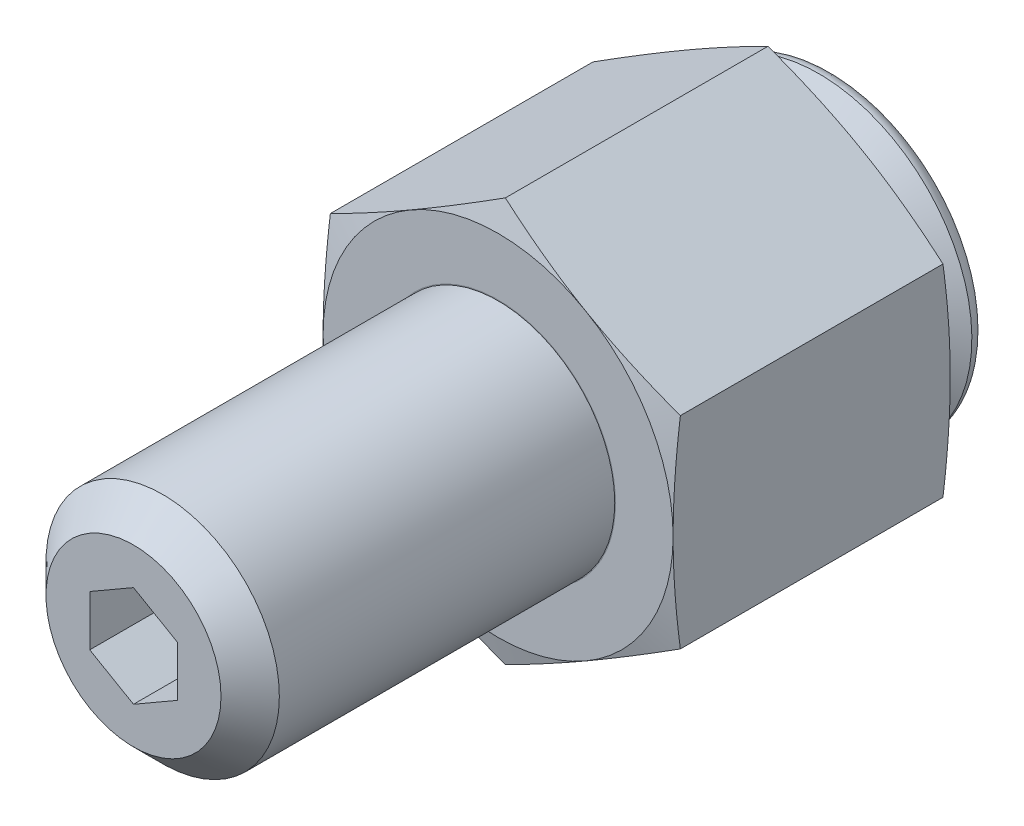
ISO-10303-21;
HEADER;
FILE_DESCRIPTION(('STEP AP214'),'2;1');
FILE_NAME('part.step','',(''),(''),'','','');
FILE_SCHEMA(('AUTOMOTIVE_DESIGN { 1 0 10303 214 1 1 1 1 }'));
ENDSEC;
DATA;
#1=APPLICATION_CONTEXT('core data for automotive mechanical design processes');
#2=APPLICATION_PROTOCOL_DEFINITION('international standard','automotive_design',2000,#1);
#3=PRODUCT_CONTEXT('',#1,'mechanical');
#4=PRODUCT('Part','Part','',(#3));
#5=PRODUCT_RELATED_PRODUCT_CATEGORY('part','',(#4));
#6=PRODUCT_DEFINITION_FORMATION('','',#4);
#7=PRODUCT_DEFINITION_CONTEXT('part definition',#1,'design');
#8=PRODUCT_DEFINITION('design','',#6,#7);
#9=PRODUCT_DEFINITION_SHAPE('','',#8);
#10=(LENGTH_UNIT() NAMED_UNIT(*) SI_UNIT(.MILLI.,.METRE.));
#11=(NAMED_UNIT(*) PLANE_ANGLE_UNIT() SI_UNIT($,.RADIAN.));
#12=(NAMED_UNIT(*) SI_UNIT($,.STERADIAN.) SOLID_ANGLE_UNIT());
#13=UNCERTAINTY_MEASURE_WITH_UNIT(LENGTH_MEASURE(1.E-05),#10,'distance_accuracy_value','');
#14=(GEOMETRIC_REPRESENTATION_CONTEXT(3) GLOBAL_UNCERTAINTY_ASSIGNED_CONTEXT((#13)) GLOBAL_UNIT_ASSIGNED_CONTEXT((#10,
#11,#12)) REPRESENTATION_CONTEXT('',''));
#15=CARTESIAN_POINT('',(0.,0.,0.));
#16=DIRECTION('',(0.,0.,1.));
#17=DIRECTION('',(1.,0.,0.));
#18=AXIS2_PLACEMENT_3D('',#15,#16,#17);
#19=CARTESIAN_POINT('',(0.,0.,8.259600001));
#20=DIRECTION('',(0.,0.,-1.));
#21=DIRECTION('',(-0.159157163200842,0.987253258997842,0.));
#22=AXIS2_PLACEMENT_3D('',#19,#20,#21);
#23=SPHERICAL_SURFACE('',#22,10.);
#24=CARTESIAN_POINT('',(0.,0.,5.778000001));
#25=DIRECTION('',(0.,0.,-1.));
#26=DIRECTION('',(-0.987253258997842,-0.159157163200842,0.));
#27=AXIS2_PLACEMENT_3D('',#24,#25,#26);
#28=CIRCLE('',#27,9.68719058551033);
#29=CARTESIAN_POINT('',(-1.54178577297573,9.56371047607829,5.778000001));
#30=VERTEX_POINT('',#29);
#31=EDGE_CURVE('E9',#30,#30,#28,.F.);
#32=CARTESIAN_POINT('',(0.,0.,3.73430752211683));
#33=DIRECTION('',(0.,0.,1.));
#34=DIRECTION('',(-0.159157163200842,0.987253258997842,0.));
#35=AXIS2_PLACEMENT_3D('',#32,#33,#34);
#36=CIRCLE('',#35,8.91749561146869);
#37=CARTESIAN_POINT('',(-1.41928330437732,8.80382660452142,3.73430752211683));
#38=VERTEX_POINT('',#37);
#39=EDGE_CURVE('E358',#38,#38,#36,.T.);
#40=CARTESIAN_POINT('',(-1.54178577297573,9.56371047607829,5.778000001));
#41=CARTESIAN_POINT('',(-1.54088550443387,9.55812610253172,5.7559193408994));
#42=CARTESIAN_POINT('',(-1.53997321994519,9.55246719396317,5.73385802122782));
#43=CARTESIAN_POINT('',(-1.53812466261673,9.54100057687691,5.68977509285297));
#44=CARTESIAN_POINT('',(-1.53718838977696,9.5351928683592,5.66775348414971));
#45=CARTESIAN_POINT('',(-1.53529189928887,9.52342892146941,5.62375100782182));
#46=CARTESIAN_POINT('',(-1.53433168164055,9.51747268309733,5.60177014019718));
#47=CARTESIAN_POINT('',(-1.53238734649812,9.50541195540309,5.55785017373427));
#48=CARTESIAN_POINT('',(-1.531403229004,9.49930746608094,5.53591107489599));
#49=CARTESIAN_POINT('',(-1.52941114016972,9.48695052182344,5.49207567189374));
#50=CARTESIAN_POINT('',(-1.52840316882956,9.48069806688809,5.47017936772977));
#51=CARTESIAN_POINT('',(-1.52636341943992,9.46804548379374,5.42643057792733));
#52=CARTESIAN_POINT('',(-1.52533164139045,9.46164535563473,5.40457809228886));
#53=CARTESIAN_POINT('',(-1.5232443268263,9.44869772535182,5.36091796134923));
#54=CARTESIAN_POINT('',(-1.52218879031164,9.44215022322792,5.33911031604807));
#55=CARTESIAN_POINT('',(-1.52005400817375,9.42890815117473,5.29554088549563));
#56=CARTESIAN_POINT('',(-1.51897476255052,9.42221358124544,5.27377910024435));
#57=CARTESIAN_POINT('',(-1.51679261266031,9.40867768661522,5.23030240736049));
#58=CARTESIAN_POINT('',(-1.51568970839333,9.40183636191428,5.20858749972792));
#59=CARTESIAN_POINT('',(-1.51346029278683,9.38800727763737,5.16520557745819));
#60=CARTESIAN_POINT('',(-1.5123337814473,9.38101951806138,5.14353856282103));
#61=CARTESIAN_POINT('',(-1.51005720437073,9.366897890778,5.10025343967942));
#62=CARTESIAN_POINT('',(-1.50890713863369,9.35976402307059,5.07863533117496));
#63=CARTESIAN_POINT('',(-1.50658350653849,9.34535051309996,5.03544903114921));
#64=CARTESIAN_POINT('',(-1.50540994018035,9.33807087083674,5.01388083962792));
#65=CARTESIAN_POINT('',(-1.50303936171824,9.32336615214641,4.97079538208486));
#66=CARTESIAN_POINT('',(-1.50184234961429,9.31594107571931,4.9492781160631));
#67=CARTESIAN_POINT('',(-1.49942493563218,9.30094583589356,4.90629551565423));
#68=CARTESIAN_POINT('',(-1.49820453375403,9.29337567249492,4.88483018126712));
#69=CARTESIAN_POINT('',(-1.49574039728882,9.27809061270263,4.84195244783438));
#70=CARTESIAN_POINT('',(-1.49449666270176,9.27037571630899,4.82054004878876));
#71=CARTESIAN_POINT('',(-1.49198591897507,9.25480155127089,4.7777691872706));
#72=CARTESIAN_POINT('',(-1.49071890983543,9.24694228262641,4.75641072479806));
#73=CARTESIAN_POINT('',(-1.4881616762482,9.23107974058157,4.71374873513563));
#74=CARTESIAN_POINT('',(-1.48687145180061,9.2230764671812,4.69244520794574));
#75=CARTESIAN_POINT('',(-1.48426784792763,9.20692628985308,4.64989408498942));
#76=CARTESIAN_POINT('',(-1.48295446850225,9.19877938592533,4.62864648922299));
#77=CARTESIAN_POINT('',(-1.48030461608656,9.18234232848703,4.58620822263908));
#78=CARTESIAN_POINT('',(-1.47896814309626,9.17405217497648,4.56501755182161));
#79=CARTESIAN_POINT('',(-1.47627216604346,9.15732900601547,4.52269412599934));
#80=CARTESIAN_POINT('',(-1.47491266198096,9.148895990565,4.50156137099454));
#81=CARTESIAN_POINT('',(-1.47217068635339,9.13188749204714,4.45935476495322));
#82=CARTESIAN_POINT('',(-1.47078821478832,9.12331200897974,4.4382809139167));
#83=CARTESIAN_POINT('',(-1.46800036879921,9.10601897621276,4.39619310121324));
#84=CARTESIAN_POINT('',(-1.46659499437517,9.09730142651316,4.37517913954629));
#85=CARTESIAN_POINT('',(-1.46376140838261,9.07972466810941,4.33321208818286));
#86=CARTESIAN_POINT('',(-1.46233319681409,9.07086545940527,4.31225899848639));
#87=CARTESIAN_POINT('',(-1.45945400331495,9.05300579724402,4.27041467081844));
#88=CARTESIAN_POINT('',(-1.45800302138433,9.04400534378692,4.24952343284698));
#89=CARTESIAN_POINT('',(-1.45507835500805,9.02586361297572,4.20780378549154));
#90=CARTESIAN_POINT('',(-1.45360467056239,9.01672233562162,4.18697537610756));
#91=CARTESIAN_POINT('',(-1.45063466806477,8.99829938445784,4.14538235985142));
#92=CARTESIAN_POINT('',(-1.4491383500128,8.98901771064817,4.12461775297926));
#93=CARTESIAN_POINT('',(-1.44612315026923,8.97031440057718,4.0831533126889));
#94=CARTESIAN_POINT('',(-1.44460426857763,8.96089276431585,4.0624534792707));
#95=CARTESIAN_POINT('',(-1.44154401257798,8.94190996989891,4.02111955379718));
#96=CARTESIAN_POINT('',(-1.44000263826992,8.93234881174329,4.00048546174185));
#97=CARTESIAN_POINT('',(-1.43689746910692,8.9130874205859,3.95928398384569));
#98=CARTESIAN_POINT('',(-1.43533367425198,8.90338718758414,3.93871659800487));
#99=CARTESIAN_POINT('',(-1.43218373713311,8.88384810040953,3.89764949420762));
#100=CARTESIAN_POINT('',(-1.43059759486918,8.87400924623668,3.87714977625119));
#101=CARTESIAN_POINT('',(-1.42740303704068,8.85419337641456,3.83621896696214));
#102=CARTESIAN_POINT('',(-1.4257946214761,8.84421636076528,3.8157878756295));
#103=CARTESIAN_POINT('',(-1.42255559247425,8.82412463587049,3.77499527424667));
#104=CARTESIAN_POINT('',(-1.42092497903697,8.81400992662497,3.75463376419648));
#105=CARTESIAN_POINT('',(-1.41928330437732,8.80382660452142,3.73430752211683));
#106=B_SPLINE_CURVE_WITH_KNOTS('',3,(#40,#41,#42,#43,#44,#45,#46,#47,#48,#49,#50,#51,#52,#53,
#54,#55,#56,#57,#58,#59,#60,#61,#62,#63,#64,#65,#66,#67,#68,#69,#70,#71,#72,#73,#74,#75,#76,#77,
#78,#79,#80,#81,#82,#83,#84,#85,#86,#87,#88,#89,#90,#91,#92,#93,#94,#95,#96,#97,#98,#99,#100,
#101,#102,#103,#104,#105),.UNSPECIFIED.,.F.,.F.,(4,2,2,2,2,2,2,2,2,2,2,2,2,2,2,2,2,2,2,2,2,2,2,
2,2,2,2,2,2,2,2,2,4),(0.,0.0683808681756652,0.13676173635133,0.205142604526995,
0.273523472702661,0.341904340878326,0.410285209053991,0.478666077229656,0.547046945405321,
0.615427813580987,0.683808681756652,0.752189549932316,0.820570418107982,0.888951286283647,
0.957332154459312,1.02571302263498,1.09409389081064,1.16247475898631,1.23085562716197,
1.29923649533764,1.3676173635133,1.43599823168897,1.50437909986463,1.5727599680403,
1.64114083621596,1.70952170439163,1.77790257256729,1.84628344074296,1.91466430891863,
1.98304517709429,2.05142604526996,2.11980691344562,2.18818778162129),.UNSPECIFIED.);
#107=EDGE_CURVE('BSEAM14',#30,#38,#106,.T.);
#108=ORIENTED_EDGE('',*,*,#31,.F.);
#109=ORIENTED_EDGE('',*,*,#39,.T.);
#110=ORIENTED_EDGE('',*,*,#107,.T.);
#111=ORIENTED_EDGE('',*,*,#107,.F.);
#112=EDGE_LOOP('',(#108,#110,#109,#111));
#113=FACE_BOUND('',#112,.T.);
#114=ADVANCED_FACE('F14',(#113),#23,.T.);
#115=CARTESIAN_POINT('',(0.,0.,0.));
#116=DIRECTION('',(0.,0.,-1.));
#117=DIRECTION('',(0.159157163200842,-0.987253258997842,0.));
#118=AXIS2_PLACEMENT_3D('',#115,#116,#117);
#119=CYLINDRICAL_SURFACE('',#118,8.89);
#120=CARTESIAN_POINT('',(0.,0.,3.6193650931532));
#121=DIRECTION('',(0.,0.,1.));
#122=DIRECTION('',(-0.159157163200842,0.987253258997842,0.));
#123=AXIS2_PLACEMENT_3D('',#120,#121,#122);
#124=CIRCLE('',#123,8.89);
#125=CARTESIAN_POINT('',(-1.41490718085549,8.77668147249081,3.6193650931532));
#126=VERTEX_POINT('',#125);
#127=EDGE_CURVE('E356',#126,#126,#124,.F.);
#128=ORIENTED_EDGE('',*,*,#127,.T.);
#129=EDGE_LOOP('',(#128));
#130=FACE_BOUND('',#129,.T.);
#131=CARTESIAN_POINT('',(0.,0.,2.09218090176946));
#132=DIRECTION('',(0.,0.,-1.));
#133=DIRECTION('',(0.159157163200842,-0.987253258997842,0.));
#134=AXIS2_PLACEMENT_3D('',#131,#132,#133);
#135=CIRCLE('',#134,8.89);
#136=CARTESIAN_POINT('',(1.41490718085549,-8.77668147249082,2.09218090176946));
#137=VERTEX_POINT('',#136);
#138=EDGE_CURVE('E353',#137,#137,#135,.F.);
#139=ORIENTED_EDGE('',*,*,#138,.T.);
#140=EDGE_LOOP('',(#139));
#141=FACE_BOUND('',#140,.T.);
#142=ADVANCED_FACE('F377',(#130,#141),#119,.T.);
#143=CARTESIAN_POINT('',(0.,0.,1.94553393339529));
#144=DIRECTION('',(0.,0.,-1.));
#145=DIRECTION('',(0.159157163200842,-0.987253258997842,0.));
#146=AXIS2_PLACEMENT_3D('',#143,#144,#145);
#147=CONICAL_SURFACE('',#146,8.89,1.0471975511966);
#148=CARTESIAN_POINT('',(0.,0.,1.87221044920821));
#149=DIRECTION('',(0.,0.,-1.));
#150=DIRECTION('',(0.159157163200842,-0.987253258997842,0.));
#151=AXIS2_PLACEMENT_3D('',#148,#149,#150);
#152=CIRCLE('',#151,9.017);
#153=CARTESIAN_POINT('',(1.43512014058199,-8.90206263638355,1.87221044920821));
#154=VERTEX_POINT('',#153);
#155=EDGE_CURVE('E18',#154,#154,#152,.T.);
#156=ORIENTED_EDGE('',*,*,#155,.T.);
#157=EDGE_LOOP('',(#156));
#158=FACE_BOUND('',#157,.T.);
#159=CARTESIAN_POINT('',(0.,0.,1.016));
#160=DIRECTION('',(0.,0.,-1.));
#161=DIRECTION('',(0.159157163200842,-0.987253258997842,0.));
#162=AXIS2_PLACEMENT_3D('',#159,#160,#161);
#163=CIRCLE('',#162,10.5);
#164=CARTESIAN_POINT('',(1.67115021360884,-10.3661592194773,1.016));
#165=VERTEX_POINT('',#164);
#166=EDGE_CURVE('E347',#165,#165,#163,.T.);
#167=ORIENTED_EDGE('',*,*,#166,.F.);
#168=EDGE_LOOP('',(#167));
#169=FACE_BOUND('',#168,.T.);
#170=ADVANCED_FACE('F383',(#158,#169),#147,.T.);
#171=CARTESIAN_POINT('',(-1.67115021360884,10.3661592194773,0.));
#172=DIRECTION('',(0.,0.,1.));
#173=DIRECTION('',(-0.159157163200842,0.987253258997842,0.));
#174=AXIS2_PLACEMENT_3D('',#171,#172,#173);
#175=PLANE('',#174);
#176=CARTESIAN_POINT('',(0.,0.,0.));
#177=DIRECTION('',(0.,0.,1.));
#178=DIRECTION('',(-0.159157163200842,0.987253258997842,0.));
#179=AXIS2_PLACEMENT_3D('',#176,#177,#178);
#180=CIRCLE('',#179,9.484);
#181=CARTESIAN_POINT('',(-1.50944653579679,9.36310990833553,0.));
#182=VERTEX_POINT('',#181);
#183=EDGE_CURVE('E350',#182,#182,#180,.F.);
#184=ORIENTED_EDGE('',*,*,#183,.T.);
#185=EDGE_LOOP('',(#184));
#186=FACE_BOUND('',#185,.T.);
#187=ADVANCED_FACE('F491',(#186),#175,.F.);
#188=CARTESIAN_POINT('',(0.,0.,1.016));
#189=DIRECTION('',(0.,0.,1.));
#190=DIRECTION('',(-0.159157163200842,0.987253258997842,0.));
#191=AXIS2_PLACEMENT_3D('',#188,#189,#190);
#192=TOROIDAL_SURFACE('',#191,9.484,1.016);
#193=ORIENTED_EDGE('',*,*,#166,.T.);
#194=EDGE_LOOP('',(#193));
#195=FACE_BOUND('',#194,.T.);
#196=ORIENTED_EDGE('',*,*,#183,.F.);
#197=EDGE_LOOP('',(#196));
#198=FACE_BOUND('',#197,.T.);
#199=ADVANCED_FACE('F494',(#195,#198),#192,.T.);
#200=CARTESIAN_POINT('',(0.,0.,3.6193650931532));
#201=DIRECTION('',(0.,0.,1.));
#202=DIRECTION('',(-0.159157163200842,0.987253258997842,0.));
#203=AXIS2_PLACEMENT_3D('',#200,#201,#202);
#204=TOROIDAL_SURFACE('',#203,9.144,0.254);
#205=ORIENTED_EDGE('',*,*,#39,.F.);
#206=EDGE_LOOP('',(#205));
#207=FACE_BOUND('',#206,.T.);
#208=ORIENTED_EDGE('',*,*,#127,.F.);
#209=EDGE_LOOP('',(#208));
#210=FACE_BOUND('',#209,.T.);
#211=ADVANCED_FACE('F395',(#207,#210),#204,.F.);
#212=CARTESIAN_POINT('',(0.,0.,2.09218090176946));
#213=DIRECTION('',(0.,0.,-1.));
#214=DIRECTION('',(0.159157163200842,-0.987253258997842,0.));
#215=AXIS2_PLACEMENT_3D('',#212,#213,#214);
#216=TOROIDAL_SURFACE('',#215,9.144,0.254);
#217=ORIENTED_EDGE('',*,*,#138,.F.);
#218=EDGE_LOOP('',(#217));
#219=FACE_BOUND('',#218,.T.);
#220=ORIENTED_EDGE('',*,*,#155,.F.);
#221=EDGE_LOOP('',(#220));
#222=FACE_BOUND('',#221,.T.);
#223=ADVANCED_FACE('F16',(#219,#222),#216,.F.);
#224=CARTESIAN_POINT('',(6.,0.,41.500000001));
#225=DIRECTION('',(0.,0.,-1.));
#226=DIRECTION('',(-1.,0.,0.));
#227=AXIS2_PLACEMENT_3D('',#224,#225,#226);
#228=PLANE('',#227);
#229=DIRECTION('',(-0.866025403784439,0.5,0.));
#230=VECTOR('',#229,1.);
#231=CARTESIAN_POINT('',(3.,1.73205080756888,41.500000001));
#232=LINE('',#231,#230);
#233=CARTESIAN_POINT('',(3.,1.73205080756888,41.500000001));
#234=VERTEX_POINT('',#233);
#235=CARTESIAN_POINT('',(0.,3.46410161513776,41.500000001));
#236=VERTEX_POINT('',#235);
#237=EDGE_CURVE('E143',#234,#236,#232,.T.);
#238=ORIENTED_EDGE('',*,*,#237,.T.);
#239=DIRECTION('',(-0.866025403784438,-0.5,0.));
#240=VECTOR('',#239,1.);
#241=CARTESIAN_POINT('',(0.,3.46410161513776,41.500000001));
#242=LINE('',#241,#240);
#243=CARTESIAN_POINT('',(-3.,1.73205080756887,41.500000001));
#244=VERTEX_POINT('',#243);
#245=EDGE_CURVE('E152',#236,#244,#242,.T.);
#246=ORIENTED_EDGE('',*,*,#245,.T.);
#247=DIRECTION('',(0.,-1.,0.));
#248=VECTOR('',#247,1.);
#249=CARTESIAN_POINT('',(-3.,1.73205080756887,41.500000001));
#250=LINE('',#249,#248);
#251=CARTESIAN_POINT('',(-3.,-1.73205080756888,41.500000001));
#252=VERTEX_POINT('',#251);
#253=EDGE_CURVE('E157',#244,#252,#250,.T.);
#254=ORIENTED_EDGE('',*,*,#253,.T.);
#255=DIRECTION('',(0.866025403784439,-0.5,0.));
#256=VECTOR('',#255,1.);
#257=CARTESIAN_POINT('',(-3.,-1.73205080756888,41.500000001));
#258=LINE('',#257,#256);
#259=CARTESIAN_POINT('',(0.,-3.46410161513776,41.500000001));
#260=VERTEX_POINT('',#259);
#261=EDGE_CURVE('E171',#252,#260,#258,.T.);
#262=ORIENTED_EDGE('',*,*,#261,.T.);
#263=DIRECTION('',(0.866025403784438,0.5,0.));
#264=VECTOR('',#263,1.);
#265=CARTESIAN_POINT('',(0.,-3.46410161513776,41.500000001));
#266=LINE('',#265,#264);
#267=CARTESIAN_POINT('',(3.,-1.73205080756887,41.500000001));
#268=VERTEX_POINT('',#267);
#269=EDGE_CURVE('E174',#260,#268,#266,.T.);
#270=ORIENTED_EDGE('',*,*,#269,.T.);
#271=DIRECTION('',(0.,1.,0.));
#272=VECTOR('',#271,1.);
#273=CARTESIAN_POINT('',(3.,-1.73205080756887,41.500000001));
#274=LINE('',#273,#272);
#275=EDGE_CURVE('E149',#268,#234,#274,.T.);
#276=ORIENTED_EDGE('',*,*,#275,.T.);
#277=EDGE_LOOP('',(#238,#246,#254,#262,#270,#276));
#278=FACE_BOUND('',#277,.T.);
#279=ADVANCED_FACE('F159',(#278),#228,.F.);
#280=CARTESIAN_POINT('',(0.,3.46410161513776,41.500000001));
#281=DIRECTION('',(-0.5,0.866025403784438,0.));
#282=DIRECTION('',(0.866025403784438,0.5,0.));
#283=AXIS2_PLACEMENT_3D('',#280,#281,#282);
#284=PLANE('',#283);
#285=DIRECTION('',(-0.866025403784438,-0.5,0.));
#286=VECTOR('',#285,1.);
#287=CARTESIAN_POINT('',(0.,3.46410161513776,48.000000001));
#288=LINE('',#287,#286);
#289=CARTESIAN_POINT('',(0.,3.46410161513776,48.000000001));
#290=VERTEX_POINT('',#289);
#291=CARTESIAN_POINT('',(-3.,1.73205080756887,48.000000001));
#292=VERTEX_POINT('',#291);
#293=EDGE_CURVE('E178',#290,#292,#288,.T.);
#294=ORIENTED_EDGE('',*,*,#293,.T.);
#295=DIRECTION('',(0.,0.,1.));
#296=VECTOR('',#295,1.);
#297=CARTESIAN_POINT('',(-3.,1.73205080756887,41.500000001));
#298=LINE('',#297,#296);
#299=EDGE_CURVE('E148',#244,#292,#298,.T.);
#300=ORIENTED_EDGE('',*,*,#299,.F.);
#301=ORIENTED_EDGE('',*,*,#245,.F.);
#302=DIRECTION('',(0.,0.,1.));
#303=VECTOR('',#302,1.);
#304=CARTESIAN_POINT('',(0.,3.46410161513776,41.500000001));
#305=LINE('',#304,#303);
#306=EDGE_CURVE('E139',#236,#290,#305,.T.);
#307=ORIENTED_EDGE('',*,*,#306,.T.);
#308=EDGE_LOOP('',(#294,#300,#301,#307));
#309=FACE_BOUND('',#308,.T.);
#310=ADVANCED_FACE('F153',(#309),#284,.F.);
#311=CARTESIAN_POINT('',(-3.,1.73205080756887,41.500000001));
#312=DIRECTION('',(-1.,0.,0.));
#313=DIRECTION('',(0.,1.,0.));
#314=AXIS2_PLACEMENT_3D('',#311,#312,#313);
#315=PLANE('',#314);
#316=DIRECTION('',(0.,-1.,0.));
#317=VECTOR('',#316,1.);
#318=CARTESIAN_POINT('',(-3.,1.73205080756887,48.000000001));
#319=LINE('',#318,#317);
#320=CARTESIAN_POINT('',(-3.,-1.73205080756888,48.000000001));
#321=VERTEX_POINT('',#320);
#322=EDGE_CURVE('E180',#292,#321,#319,.T.);
#323=ORIENTED_EDGE('',*,*,#322,.T.);
#324=DIRECTION('',(0.,0.,1.));
#325=VECTOR('',#324,1.);
#326=CARTESIAN_POINT('',(-3.,-1.73205080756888,41.500000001));
#327=LINE('',#326,#325);
#328=EDGE_CURVE('E195',#252,#321,#327,.T.);
#329=ORIENTED_EDGE('',*,*,#328,.F.);
#330=ORIENTED_EDGE('',*,*,#253,.F.);
#331=ORIENTED_EDGE('',*,*,#299,.T.);
#332=EDGE_LOOP('',(#323,#329,#330,#331));
#333=FACE_BOUND('',#332,.T.);
#334=ADVANCED_FACE('F393',(#333),#315,.F.);
#335=CARTESIAN_POINT('',(-3.,-1.73205080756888,41.500000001));
#336=DIRECTION('',(-0.5,-0.866025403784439,0.));
#337=DIRECTION('',(-0.866025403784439,0.5,0.));
#338=AXIS2_PLACEMENT_3D('',#335,#336,#337);
#339=PLANE('',#338);
#340=DIRECTION('',(0.866025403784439,-0.5,0.));
#341=VECTOR('',#340,1.);
#342=CARTESIAN_POINT('',(-3.,-1.73205080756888,48.000000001));
#343=LINE('',#342,#341);
#344=CARTESIAN_POINT('',(0.,-3.46410161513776,48.000000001));
#345=VERTEX_POINT('',#344);
#346=EDGE_CURVE('E183',#321,#345,#343,.T.);
#347=ORIENTED_EDGE('',*,*,#346,.T.);
#348=DIRECTION('',(0.,0.,1.));
#349=VECTOR('',#348,1.);
#350=CARTESIAN_POINT('',(0.,-3.46410161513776,41.500000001));
#351=LINE('',#350,#349);
#352=EDGE_CURVE('E193',#260,#345,#351,.T.);
#353=ORIENTED_EDGE('',*,*,#352,.F.);
#354=ORIENTED_EDGE('',*,*,#261,.F.);
#355=ORIENTED_EDGE('',*,*,#328,.T.);
#356=EDGE_LOOP('',(#347,#353,#354,#355));
#357=FACE_BOUND('',#356,.T.);
#358=ADVANCED_FACE('F405',(#357),#339,.F.);
#359=CARTESIAN_POINT('',(0.,-3.46410161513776,41.500000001));
#360=DIRECTION('',(0.5,-0.866025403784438,0.));
#361=DIRECTION('',(-0.866025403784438,-0.5,0.));
#362=AXIS2_PLACEMENT_3D('',#359,#360,#361);
#363=PLANE('',#362);
#364=DIRECTION('',(0.866025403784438,0.5,0.));
#365=VECTOR('',#364,1.);
#366=CARTESIAN_POINT('',(0.,-3.46410161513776,48.000000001));
#367=LINE('',#366,#365);
#368=CARTESIAN_POINT('',(3.,-1.73205080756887,48.000000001));
#369=VERTEX_POINT('',#368);
#370=EDGE_CURVE('E165',#345,#369,#367,.T.);
#371=ORIENTED_EDGE('',*,*,#370,.T.);
#372=DIRECTION('',(0.,0.,1.));
#373=VECTOR('',#372,1.);
#374=CARTESIAN_POINT('',(3.,-1.73205080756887,41.500000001));
#375=LINE('',#374,#373);
#376=EDGE_CURVE('E191',#268,#369,#375,.T.);
#377=ORIENTED_EDGE('',*,*,#376,.F.);
#378=ORIENTED_EDGE('',*,*,#269,.F.);
#379=ORIENTED_EDGE('',*,*,#352,.T.);
#380=EDGE_LOOP('',(#371,#377,#378,#379));
#381=FACE_BOUND('',#380,.T.);
#382=ADVANCED_FACE('F401',(#381),#363,.F.);
#383=CARTESIAN_POINT('',(3.,-1.73205080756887,41.500000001));
#384=DIRECTION('',(1.,0.,0.));
#385=DIRECTION('',(0.,0.,-1.));
#386=AXIS2_PLACEMENT_3D('',#383,#384,#385);
#387=PLANE('',#386);
#388=DIRECTION('',(0.,1.,0.));
#389=VECTOR('',#388,1.);
#390=CARTESIAN_POINT('',(3.,-1.73205080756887,48.000000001));
#391=LINE('',#390,#389);
#392=CARTESIAN_POINT('',(3.,1.73205080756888,48.000000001));
#393=VERTEX_POINT('',#392);
#394=EDGE_CURVE('E162',#369,#393,#391,.T.);
#395=ORIENTED_EDGE('',*,*,#394,.T.);
#396=DIRECTION('',(0.,0.,1.));
#397=VECTOR('',#396,1.);
#398=CARTESIAN_POINT('',(3.,1.73205080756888,41.500000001));
#399=LINE('',#398,#397);
#400=EDGE_CURVE('E188',#234,#393,#399,.T.);
#401=ORIENTED_EDGE('',*,*,#400,.F.);
#402=ORIENTED_EDGE('',*,*,#275,.F.);
#403=ORIENTED_EDGE('',*,*,#376,.T.);
#404=EDGE_LOOP('',(#395,#401,#402,#403));
#405=FACE_BOUND('',#404,.T.);
#406=ADVANCED_FACE('F398',(#405),#387,.F.);
#407=CARTESIAN_POINT('',(3.,1.73205080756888,41.500000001));
#408=DIRECTION('',(0.5,0.866025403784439,0.));
#409=DIRECTION('',(0.866025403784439,-0.5,0.));
#410=AXIS2_PLACEMENT_3D('',#407,#408,#409);
#411=PLANE('',#410);
#412=DIRECTION('',(-0.866025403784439,0.5,0.));
#413=VECTOR('',#412,1.);
#414=CARTESIAN_POINT('',(3.,1.73205080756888,48.000000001));
#415=LINE('',#414,#413);
#416=EDGE_CURVE('E31',#393,#290,#415,.T.);
#417=ORIENTED_EDGE('',*,*,#416,.T.);
#418=ORIENTED_EDGE('',*,*,#306,.F.);
#419=ORIENTED_EDGE('',*,*,#237,.F.);
#420=ORIENTED_EDGE('',*,*,#400,.T.);
#421=EDGE_LOOP('',(#417,#418,#419,#420));
#422=FACE_BOUND('',#421,.T.);
#423=ADVANCED_FACE('F141',(#422),#411,.F.);
#424=CARTESIAN_POINT('',(0.,0.,48.000000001));
#425=DIRECTION('',(0.,0.,1.));
#426=DIRECTION('',(1.,0.,0.));
#427=AXIS2_PLACEMENT_3D('',#424,#425,#426);
#428=PLANE('',#427);
#429=ORIENTED_EDGE('',*,*,#416,.F.);
#430=ORIENTED_EDGE('',*,*,#394,.F.);
#431=ORIENTED_EDGE('',*,*,#370,.F.);
#432=ORIENTED_EDGE('',*,*,#346,.F.);
#433=ORIENTED_EDGE('',*,*,#322,.F.);
#434=ORIENTED_EDGE('',*,*,#293,.F.);
#435=EDGE_LOOP('',(#429,#430,#431,#432,#433,#434));
#436=FACE_BOUND('',#435,.T.);
#437=CARTESIAN_POINT('',(0.,0.,48.000000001));
#438=DIRECTION('',(0.,0.,1.));
#439=DIRECTION('',(1.,0.,0.));
#440=AXIS2_PLACEMENT_3D('',#437,#438,#439);
#441=CIRCLE('',#440,6.);
#442=CARTESIAN_POINT('',(6.,0.,48.000000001));
#443=VERTEX_POINT('',#442);
#444=EDGE_CURVE('E342',#443,#443,#441,.T.);
#445=ORIENTED_EDGE('',*,*,#444,.T.);
#446=EDGE_LOOP('',(#445));
#447=FACE_BOUND('',#446,.T.);
#448=ADVANCED_FACE('F415',(#436,#447),#428,.T.);
#449=CARTESIAN_POINT('',(0.,0.,48.000000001));
#450=DIRECTION('',(0.,0.,-1.));
#451=DIRECTION('',(-1.,0.,0.));
#452=AXIS2_PLACEMENT_3D('',#449,#450,#451);
#453=CONICAL_SURFACE('',#452,6.,0.785398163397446);
#454=CARTESIAN_POINT('',(0.,0.,46.000000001));
#455=DIRECTION('',(0.,0.,1.));
#456=DIRECTION('',(1.,0.,0.));
#457=AXIS2_PLACEMENT_3D('',#454,#455,#456);
#458=CIRCLE('',#457,8.);
#459=CARTESIAN_POINT('',(8.,0.,46.000000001));
#460=VERTEX_POINT('',#459);
#461=EDGE_CURVE('E23',#460,#460,#458,.F.);
#462=ORIENTED_EDGE('',*,*,#461,.F.);
#463=EDGE_LOOP('',(#462));
#464=FACE_BOUND('',#463,.T.);
#465=ORIENTED_EDGE('',*,*,#444,.F.);
#466=EDGE_LOOP('',(#465));
#467=FACE_BOUND('',#466,.T.);
#468=ADVANCED_FACE('F417',(#464,#467),#453,.T.);
#469=CARTESIAN_POINT('',(0.,0.,48.000000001));
#470=DIRECTION('',(0.,0.,-1.));
#471=DIRECTION('',(-1.,0.,0.));
#472=AXIS2_PLACEMENT_3D('',#469,#470,#471);
#473=CYLINDRICAL_SURFACE('',#472,8.);
#474=ORIENTED_EDGE('',*,*,#461,.T.);
#475=EDGE_LOOP('',(#474));
#476=FACE_BOUND('',#475,.T.);
#477=CARTESIAN_POINT('',(0.,0.,23.0008805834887));
#478=DIRECTION('',(0.,0.,1.));
#479=DIRECTION('',(1.,0.,0.));
#480=AXIS2_PLACEMENT_3D('',#477,#478,#479);
#481=CIRCLE('',#480,8.);
#482=CARTESIAN_POINT('',(8.,0.,23.0008805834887));
#483=VERTEX_POINT('',#482);
#484=EDGE_CURVE('E190',#483,#483,#481,.F.);
#485=ORIENTED_EDGE('',*,*,#484,.F.);
#486=EDGE_LOOP('',(#485));
#487=FACE_BOUND('',#486,.T.);
#488=ADVANCED_FACE('F419',(#476,#487),#473,.T.);
#489=CARTESIAN_POINT('',(0.,0.,24.524000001));
#490=DIRECTION('',(0.,0.,-1.));
#491=DIRECTION('',(-1.,0.,0.));
#492=AXIS2_PLACEMENT_3D('',#489,#490,#491);
#493=TOROIDAL_SURFACE('',#492,8.0518,1.524);
#494=ORIENTED_EDGE('',*,*,#484,.T.);
#495=EDGE_LOOP('',(#494));
#496=FACE_BOUND('',#495,.T.);
#497=CARTESIAN_POINT('',(0.,0.,23.000000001));
#498=DIRECTION('',(0.,0.,-1.));
#499=DIRECTION('',(-1.,0.,0.));
#500=AXIS2_PLACEMENT_3D('',#497,#498,#499);
#501=CIRCLE('',#500,8.0518);
#502=CARTESIAN_POINT('',(-8.0518,0.,23.000000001));
#503=VERTEX_POINT('',#502);
#504=EDGE_CURVE('E339',#503,#503,#501,.T.);
#505=ORIENTED_EDGE('',*,*,#504,.F.);
#506=EDGE_LOOP('',(#505));
#507=FACE_BOUND('',#506,.T.);
#508=ADVANCED_FACE('F421',(#496,#507),#493,.F.);
#509=CARTESIAN_POINT('',(-12.,20.7846096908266,23.000000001));
#510=DIRECTION('',(0.,0.,-1.));
#511=DIRECTION('',(-1.,0.,0.));
#512=AXIS2_PLACEMENT_3D('',#509,#510,#511);
#513=PLANE('',#512);
#514=CARTESIAN_POINT('',(0.,0.,23.000000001));
#515=DIRECTION('',(0.,0.,-1.));
#516=DIRECTION('',(-1.,0.,0.));
#517=AXIS2_PLACEMENT_3D('',#514,#515,#516);
#518=CIRCLE('',#517,12.);
#519=CARTESIAN_POINT('',(-12.,0.,23.000000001));
#520=VERTEX_POINT('',#519);
#521=CARTESIAN_POINT('',(-6.,10.3923048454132,23.000000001));
#522=VERTEX_POINT('',#521);
#523=EDGE_CURVE('E451',#520,#522,#518,.T.);
#524=ORIENTED_EDGE('',*,*,#523,.F.);
#525=CARTESIAN_POINT('',(0.,0.,23.000000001));
#526=DIRECTION('',(0.,0.,-1.));
#527=DIRECTION('',(-1.,0.,0.));
#528=AXIS2_PLACEMENT_3D('',#525,#526,#527);
#529=CIRCLE('',#528,12.);
#530=CARTESIAN_POINT('',(-6.,-10.3923048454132,23.000000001));
#531=VERTEX_POINT('',#530);
#532=EDGE_CURVE('E308',#531,#520,#529,.T.);
#533=ORIENTED_EDGE('',*,*,#532,.F.);
#534=CARTESIAN_POINT('',(6.,-10.3923048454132,23.000000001));
#535=VERTEX_POINT('',#534);
#536=EDGE_CURVE('E326',#535,#531,#529,.T.);
#537=ORIENTED_EDGE('',*,*,#536,.F.);
#538=CARTESIAN_POINT('',(12.,0.,23.000000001));
#539=VERTEX_POINT('',#538);
#540=EDGE_CURVE('E819',#539,#535,#529,.T.);
#541=ORIENTED_EDGE('',*,*,#540,.F.);
#542=CARTESIAN_POINT('',(6.,10.3923048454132,23.000000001));
#543=VERTEX_POINT('',#542);
#544=EDGE_CURVE('E806',#543,#539,#529,.T.);
#545=ORIENTED_EDGE('',*,*,#544,.F.);
#546=EDGE_CURVE('E327',#522,#543,#529,.T.);
#547=ORIENTED_EDGE('',*,*,#546,.F.);
#548=EDGE_LOOP('',(#524,#533,#537,#541,#545,#547));
#549=FACE_BOUND('',#548,.T.);
#550=ORIENTED_EDGE('',*,*,#504,.T.);
#551=EDGE_LOOP('',(#550));
#552=FACE_BOUND('',#551,.T.);
#553=ADVANCED_FACE('F427',(#549,#552),#513,.F.);
#554=CARTESIAN_POINT('',(0.,0.,21.5858363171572));
#555=DIRECTION('',(0.,0.,-1.));
#556=DIRECTION('',(-1.,0.,0.));
#557=AXIS2_PLACEMENT_3D('',#554,#555,#556);
#558=CONICAL_SURFACE('',#557,17.2777307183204,1.30899693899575);
#559=CARTESIAN_POINT('',(12.,-18.3832707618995,20.3330380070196));
#560=CARTESIAN_POINT('',(12.,-17.8382256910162,20.4553004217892));
#561=CARTESIAN_POINT('',(12.,-17.2928412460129,20.5760768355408));
#562=CARTESIAN_POINT('',(12.,-16.2012268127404,20.8138554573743));
#563=CARTESIAN_POINT('',(12.,-15.6549967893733,20.9308575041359));
#564=CARTESIAN_POINT('',(12.,-14.5610430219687,21.1603853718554));
#565=CARTESIAN_POINT('',(12.,-14.013318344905,21.2729067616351));
#566=CARTESIAN_POINT('',(12.,-12.9167329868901,21.4922676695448));
#567=CARTESIAN_POINT('',(12.,-12.3678723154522,21.5991072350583));
#568=CARTESIAN_POINT('',(12.,-11.2731971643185,21.8049261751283));
#569=CARTESIAN_POINT('',(12.,-10.7273932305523,21.9039613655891));
#570=CARTESIAN_POINT('',(12.,-9.6342857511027,22.0934489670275));
#571=CARTESIAN_POINT('',(12.,-9.08698219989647,22.1839013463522));
#572=CARTESIAN_POINT('',(12.,-7.99078335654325,22.3541945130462));
#573=CARTESIAN_POINT('',(12.,-7.44188827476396,22.4340366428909));
#574=CARTESIAN_POINT('',(12.,-6.34234963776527,22.5807679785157));
#575=CARTESIAN_POINT('',(12.,-5.79170608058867,22.6476571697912));
#576=CARTESIAN_POINT('',(12.,-4.68243430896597,22.7666008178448));
#577=CARTESIAN_POINT('',(12.,-4.12378671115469,22.8184771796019));
#578=CARTESIAN_POINT('',(12.,-3.00507508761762,22.9038237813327));
#579=CARTESIAN_POINT('',(12.,-2.44501109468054,22.9372944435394));
#580=CARTESIAN_POINT('',(12.,-1.32428091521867,22.9838781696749));
#581=CARTESIAN_POINT('',(12.,-0.763615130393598,22.997000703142));
#582=CARTESIAN_POINT('',(12.,0.35781356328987,23.0020801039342));
#583=CARTESIAN_POINT('',(12.,0.918576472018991,22.9940369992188));
#584=CARTESIAN_POINT('',(12.,2.04146017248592,22.9572367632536));
#585=CARTESIAN_POINT('',(12.,2.60357843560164,22.9284040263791));
#586=CARTESIAN_POINT('',(12.,3.72650038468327,22.8516752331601));
#587=CARTESIAN_POINT('',(12.,4.28730404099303,22.8037787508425));
#588=CARTESIAN_POINT('',(12.,5.40759098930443,22.6913556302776));
#589=CARTESIAN_POINT('',(12.,5.96707316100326,22.6268180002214));
#590=CARTESIAN_POINT('',(12.,7.08423471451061,22.4838151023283));
#591=CARTESIAN_POINT('',(12.,7.64191409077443,22.4053497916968));
#592=CARTESIAN_POINT('',(12.,8.72392663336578,22.241794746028));
#593=CARTESIAN_POINT('',(12.,9.24835581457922,22.1573338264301));
#594=CARTESIAN_POINT('',(12.,10.2958159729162,21.9801069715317));
#595=CARTESIAN_POINT('',(12.,10.8188469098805,21.8873408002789));
#596=CARTESIAN_POINT('',(12.,11.8637124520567,21.6950349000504));
#597=CARTESIAN_POINT('',(12.,12.3855469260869,21.5954944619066));
#598=CARTESIAN_POINT('',(12.,13.4281250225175,21.3909013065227));
#599=CARTESIAN_POINT('',(12.,13.9488686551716,21.2858486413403));
#600=CARTESIAN_POINT('',(12.,14.989554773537,21.0712098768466));
#601=CARTESIAN_POINT('',(12.,15.5094970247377,20.961622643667));
#602=CARTESIAN_POINT('',(12.,16.5485863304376,20.7387355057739));
#603=CARTESIAN_POINT('',(12.,17.0677333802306,20.6254355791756));
#604=CARTESIAN_POINT('',(12.,18.6240890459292,20.2809782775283));
#605=CARTESIAN_POINT('',(12.,19.660285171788,20.0452481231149));
#606=CARTESIAN_POINT('',(12.,21.720435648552,19.567687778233));
#607=CARTESIAN_POINT('',(12.,22.7444095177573,19.32594123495));
#608=CARTESIAN_POINT('',(12.,24.7909351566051,18.8364279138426));
#609=CARTESIAN_POINT('',(12.,25.8134868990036,18.5886610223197));
#610=CARTESIAN_POINT('',(12.,27.8562043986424,18.0889953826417));
#611=CARTESIAN_POINT('',(12.,28.8763715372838,17.837102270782));
#612=CARTESIAN_POINT('',(12.,30.4059760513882,17.4567401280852));
#613=CARTESIAN_POINT('',(12.,30.9157281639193,17.3295344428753));
#614=CARTESIAN_POINT('',(12.,31.9350454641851,17.0743785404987));
#615=CARTESIAN_POINT('',(12.,32.4446106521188,16.9464283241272));
#616=CARTESIAN_POINT('',(12.,32.9540943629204,16.8181545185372));
#617=B_SPLINE_CURVE_WITH_KNOTS('',3,(#559,#560,#561,#562,#563,#564,#565,#566,#567,#568,#569,
#570,#571,#572,#573,#574,#575,#576,#577,#578,#579,#580,#581,#582,#583,#584,#585,#586,#587,#588,
#589,#590,#591,#592,#593,#594,#595,#596,#597,#598,#599,#600,#601,#602,#603,#604,#605,#606,#607,
#608,#609,#610,#611,#612,#613,#614,#615,#616),.UNSPECIFIED.,.F.,.F.,(4,2,2,2,2,2,2,2,2,2,2,2,2,
2,2,2,2,2,2,2,2,2,2,2,2,2,2,2,4),(0.,1.67577524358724,3.35162201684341,5.02908693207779,
6.70653785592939,8.37063128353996,10.0347308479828,11.6986196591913,13.3625103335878,
15.0453984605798,16.7282479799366,18.4103141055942,20.0923780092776,21.7805901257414,
23.4688399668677,25.1582077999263,26.8475808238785,28.4410626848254,30.0345898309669,
31.6282840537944,33.2219632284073,34.8160433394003,36.4101328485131,39.5980881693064,
42.7544374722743,45.9108464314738,49.063253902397,50.6394059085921,52.2155562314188),.UNSPECIFIED.);
#618=CARTESIAN_POINT('',(12.,-6.92820323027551,22.5025773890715));
#619=VERTEX_POINT('',#618);
#620=EDGE_CURVE('E304',#539,#619,#617,.F.);
#621=ORIENTED_EDGE('',*,*,#620,.F.);
#622=ORIENTED_EDGE('',*,*,#540,.T.);
#623=CARTESIAN_POINT('',(12.0002,-6.92808776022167,22.502546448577));
#624=CARTESIAN_POINT('',(11.5018535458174,-7.21580821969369,22.5796720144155));
#625=CARTESIAN_POINT('',(11.0026035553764,-7.50405033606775,22.6496892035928));
#626=CARTESIAN_POINT('',(10.0023405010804,-8.08155247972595,22.7727027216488));
#627=CARTESIAN_POINT('',(9.50132680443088,-8.37081287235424,22.8256921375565));
#628=CARTESIAN_POINT('',(8.50057386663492,-8.94859785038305,22.9115567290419));
#629=CARTESIAN_POINT('',(8.00084139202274,-9.23711852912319,22.944534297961));
#630=CARTESIAN_POINT('',(7.00073918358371,-9.8145278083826,22.9887538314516));
#631=CARTESIAN_POINT('',(6.50036959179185,-10.1034163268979,23.000000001));
#632=CARTESIAN_POINT('',(5.49963040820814,-10.6811933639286,23.000000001));
#633=CARTESIAN_POINT('',(4.99926081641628,-10.9700818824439,22.9887538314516));
#634=CARTESIAN_POINT('',(3.99915860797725,-11.5474911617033,22.944534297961));
#635=CARTESIAN_POINT('',(3.49942613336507,-11.8360118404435,22.9115567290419));
#636=CARTESIAN_POINT('',(2.49867319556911,-12.4137968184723,22.8256921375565));
#637=CARTESIAN_POINT('',(1.99765949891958,-12.7030572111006,22.7727027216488));
#638=CARTESIAN_POINT('',(0.997396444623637,-13.2805593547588,22.6496892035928));
#639=CARTESIAN_POINT('',(0.498146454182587,-13.5688014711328,22.5796720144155));
#640=CARTESIAN_POINT('',(-0.000200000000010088,-13.8565219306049,22.502546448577));
#641=B_SPLINE_CURVE_WITH_KNOTS('',3,(#623,#624,#625,#626,#627,#628,#629,#630,#631,#632,#633,
#634,#635,#636,#637,#638,#639,#640),.UNSPECIFIED.,.F.,.F.,(4,2,2,2,2,2,2,2,4),(0.,
1.74185054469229,3.48440735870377,5.21797126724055,6.95119970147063,8.6844281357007,
10.4179920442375,12.160548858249,13.9023994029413),.UNSPECIFIED.);
#642=EDGE_CURVE('E303',#619,#535,#641,.T.);
#643=ORIENTED_EDGE('',*,*,#642,.F.);
#644=EDGE_LOOP('',(#621,#622,#643));
#645=FACE_BOUND('',#644,.T.);
#646=ADVANCED_FACE('F439',(#645),#558,.T.);
#647=CARTESIAN_POINT('',(-0.000200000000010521,13.8565219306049,22.502546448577));
#648=CARTESIAN_POINT('',(0.498146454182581,13.5688014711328,22.5796720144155));
#649=CARTESIAN_POINT('',(0.997396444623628,13.2805593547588,22.6496892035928));
#650=CARTESIAN_POINT('',(1.99765949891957,12.7030572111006,22.7727027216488));
#651=CARTESIAN_POINT('',(2.4986731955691,12.4137968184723,22.8256921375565));
#652=CARTESIAN_POINT('',(3.49942613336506,11.8360118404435,22.9115567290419));
#653=CARTESIAN_POINT('',(3.99915860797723,11.5474911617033,22.944534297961));
#654=CARTESIAN_POINT('',(4.99926081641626,10.9700818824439,22.9887538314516));
#655=CARTESIAN_POINT('',(5.49963040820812,10.6811933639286,23.000000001));
#656=CARTESIAN_POINT('',(6.50036959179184,10.1034163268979,23.000000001));
#657=CARTESIAN_POINT('',(7.0007391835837,9.81452780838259,22.9887538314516));
#658=CARTESIAN_POINT('',(8.00084139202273,9.23711852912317,22.944534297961));
#659=CARTESIAN_POINT('',(8.50057386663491,8.94859785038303,22.9115567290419));
#660=CARTESIAN_POINT('',(9.50132680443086,8.37081287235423,22.8256921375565));
#661=CARTESIAN_POINT('',(10.0023405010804,8.08155247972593,22.7727027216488));
#662=CARTESIAN_POINT('',(11.0026035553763,7.50405033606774,22.6496892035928));
#663=CARTESIAN_POINT('',(11.5018535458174,7.21580821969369,22.5796720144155));
#664=CARTESIAN_POINT('',(12.0002,6.92808776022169,22.502546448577));
#665=B_SPLINE_CURVE_WITH_KNOTS('',3,(#647,#648,#649,#650,#651,#652,#653,#654,#655,#656,#657,
#658,#659,#660,#661,#662,#663,#664),.UNSPECIFIED.,.F.,.F.,(4,2,2,2,2,2,2,2,4),(0.,
1.74185054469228,3.48440735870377,5.21797126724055,6.95119970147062,8.6844281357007,
10.4179920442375,12.160548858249,13.9023994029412),.UNSPECIFIED.);
#666=CARTESIAN_POINT('',(12.,6.92820323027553,22.5025773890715));
#667=VERTEX_POINT('',#666);
#668=EDGE_CURVE('E470',#543,#667,#665,.T.);
#669=ORIENTED_EDGE('',*,*,#668,.F.);
#670=ORIENTED_EDGE('',*,*,#544,.T.);
#671=EDGE_CURVE('E290',#667,#539,#617,.F.);
#672=ORIENTED_EDGE('',*,*,#671,.F.);
#673=EDGE_LOOP('',(#669,#670,#672));
#674=FACE_BOUND('',#673,.T.);
#675=ADVANCED_FACE('F444',(#674),#558,.T.);
#676=CARTESIAN_POINT('',(-12.0002,6.92808776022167,22.502546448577));
#677=CARTESIAN_POINT('',(-11.5018535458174,7.21580821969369,22.5796720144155));
#678=CARTESIAN_POINT('',(-11.0026035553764,7.50405033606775,22.6496892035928));
#679=CARTESIAN_POINT('',(-10.0023405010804,8.08155247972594,22.7727027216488));
#680=CARTESIAN_POINT('',(-9.50132680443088,8.37081287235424,22.8256921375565));
#681=CARTESIAN_POINT('',(-8.50057386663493,8.94859785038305,22.9115567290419));
#682=CARTESIAN_POINT('',(-8.00084139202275,9.23711852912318,22.944534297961));
#683=CARTESIAN_POINT('',(-7.00073918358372,9.8145278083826,22.9887538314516));
#684=CARTESIAN_POINT('',(-6.50036959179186,10.1034163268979,23.000000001));
#685=CARTESIAN_POINT('',(-5.49963040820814,10.6811933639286,23.000000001));
#686=CARTESIAN_POINT('',(-4.99926081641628,10.9700818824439,22.9887538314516));
#687=CARTESIAN_POINT('',(-3.99915860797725,11.5474911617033,22.944534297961));
#688=CARTESIAN_POINT('',(-3.49942613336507,11.8360118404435,22.9115567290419));
#689=CARTESIAN_POINT('',(-2.49867319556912,12.4137968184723,22.8256921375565));
#690=CARTESIAN_POINT('',(-1.99765949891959,12.7030572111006,22.7727027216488));
#691=CARTESIAN_POINT('',(-0.997396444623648,13.2805593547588,22.6496892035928));
#692=CARTESIAN_POINT('',(-0.498146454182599,13.5688014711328,22.5796720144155));
#693=CARTESIAN_POINT('',(0.000199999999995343,13.8565219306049,22.502546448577));
#694=B_SPLINE_CURVE_WITH_KNOTS('',3,(#676,#677,#678,#679,#680,#681,#682,#683,#684,#685,#686,
#687,#688,#689,#690,#691,#692,#693),.UNSPECIFIED.,.F.,.F.,(4,2,2,2,2,2,2,2,4),(0.,
1.74185054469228,3.48440735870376,5.21797126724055,6.95119970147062,8.6844281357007,
10.4179920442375,12.160548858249,13.9023994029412),.UNSPECIFIED.);
#695=CARTESIAN_POINT('',(0.,13.856406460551,22.5025773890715));
#696=VERTEX_POINT('',#695);
#697=EDGE_CURVE('E459',#522,#696,#694,.T.);
#698=ORIENTED_EDGE('',*,*,#697,.F.);
#699=ORIENTED_EDGE('',*,*,#546,.T.);
#700=EDGE_CURVE('E473',#696,#543,#665,.T.);
#701=ORIENTED_EDGE('',*,*,#700,.F.);
#702=EDGE_LOOP('',(#698,#699,#701));
#703=FACE_BOUND('',#702,.T.);
#704=ADVANCED_FACE('F231',(#703),#558,.T.);
#705=ORIENTED_EDGE('',*,*,#523,.T.);
#706=CARTESIAN_POINT('',(-12.,6.92820323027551,22.5025773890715));
#707=VERTEX_POINT('',#706);
#708=EDGE_CURVE('E813',#707,#522,#694,.T.);
#709=ORIENTED_EDGE('',*,*,#708,.F.);
#710=CARTESIAN_POINT('',(-12.,-18.3832707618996,20.3330380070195));
#711=CARTESIAN_POINT('',(-12.,-17.8382256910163,20.4553004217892));
#712=CARTESIAN_POINT('',(-12.,-17.292841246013,20.5760768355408));
#713=CARTESIAN_POINT('',(-12.,-16.2012268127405,20.8138554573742));
#714=CARTESIAN_POINT('',(-12.,-15.6549967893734,20.9308575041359));
#715=CARTESIAN_POINT('',(-12.,-14.5610430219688,21.1603853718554));
#716=CARTESIAN_POINT('',(-12.,-14.0133183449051,21.2729067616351));
#717=CARTESIAN_POINT('',(-12.,-12.9167329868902,21.4922676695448));
#718=CARTESIAN_POINT('',(-12.,-12.3678723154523,21.5991072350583));
#719=CARTESIAN_POINT('',(-12.,-11.2731971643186,21.8049261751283));
#720=CARTESIAN_POINT('',(-12.,-10.7273932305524,21.9039613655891));
#721=CARTESIAN_POINT('',(-12.,-9.63428575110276,22.0934489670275));
#722=CARTESIAN_POINT('',(-12.,-9.08698219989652,22.1839013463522));
#723=CARTESIAN_POINT('',(-12.,-7.9907833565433,22.3541945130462));
#724=CARTESIAN_POINT('',(-12.,-7.441888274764,22.4340366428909));
#725=CARTESIAN_POINT('',(-12.,-6.34234963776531,22.5807679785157));
#726=CARTESIAN_POINT('',(-12.,-5.79170608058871,22.6476571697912));
#727=CARTESIAN_POINT('',(-12.,-4.682434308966,22.7666008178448));
#728=CARTESIAN_POINT('',(-12.,-4.12378671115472,22.8184771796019));
#729=CARTESIAN_POINT('',(-12.,-3.00507508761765,22.9038237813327));
#730=CARTESIAN_POINT('',(-12.,-2.44501109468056,22.9372944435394));
#731=CARTESIAN_POINT('',(-12.,-1.32428091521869,22.9838781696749));
#732=CARTESIAN_POINT('',(-12.,-0.763615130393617,22.997000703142));
#733=CARTESIAN_POINT('',(-12.,0.357813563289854,23.0020801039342));
#734=CARTESIAN_POINT('',(-12.,0.918576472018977,22.9940369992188));
#735=CARTESIAN_POINT('',(-12.,2.0414601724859,22.9572367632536));
#736=CARTESIAN_POINT('',(-12.,2.60357843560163,22.9284040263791));
#737=CARTESIAN_POINT('',(-12.,3.72650038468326,22.8516752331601));
#738=CARTESIAN_POINT('',(-12.,4.28730404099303,22.8037787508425));
#739=CARTESIAN_POINT('',(-12.,5.40759098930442,22.6913556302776));
#740=CARTESIAN_POINT('',(-12.,5.96707316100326,22.6268180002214));
#741=CARTESIAN_POINT('',(-12.,7.08423471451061,22.4838151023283));
#742=CARTESIAN_POINT('',(-12.,7.64191409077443,22.4053497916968));
#743=CARTESIAN_POINT('',(-12.,8.72392663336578,22.241794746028));
#744=CARTESIAN_POINT('',(-12.,9.24835581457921,22.1573338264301));
#745=CARTESIAN_POINT('',(-12.,10.2958159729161,21.9801069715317));
#746=CARTESIAN_POINT('',(-12.,10.8188469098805,21.8873408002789));
#747=CARTESIAN_POINT('',(-12.,11.8637124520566,21.6950349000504));
#748=CARTESIAN_POINT('',(-12.,12.3855469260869,21.5954944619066));
#749=CARTESIAN_POINT('',(-12.,13.4281250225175,21.3909013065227));
#750=CARTESIAN_POINT('',(-12.,13.9488686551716,21.2858486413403));
#751=CARTESIAN_POINT('',(-12.,14.989554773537,21.0712098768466));
#752=CARTESIAN_POINT('',(-12.,15.5094970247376,20.961622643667));
#753=CARTESIAN_POINT('',(-12.,16.5485863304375,20.7387355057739));
#754=CARTESIAN_POINT('',(-12.,17.0677333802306,20.6254355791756));
#755=CARTESIAN_POINT('',(-12.,18.6240890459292,20.2809782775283));
#756=CARTESIAN_POINT('',(-12.,19.660285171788,20.0452481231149));
#757=CARTESIAN_POINT('',(-12.,21.7204356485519,19.567687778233));
#758=CARTESIAN_POINT('',(-12.,22.7444095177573,19.32594123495));
#759=CARTESIAN_POINT('',(-12.,24.7909351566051,18.8364279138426));
#760=CARTESIAN_POINT('',(-12.,25.8134868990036,18.5886610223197));
#761=CARTESIAN_POINT('',(-12.,27.8562043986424,18.0889953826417));
#762=CARTESIAN_POINT('',(-12.,28.8763715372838,17.837102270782));
#763=CARTESIAN_POINT('',(-12.,30.4059760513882,17.4567401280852));
#764=CARTESIAN_POINT('',(-12.,30.9157281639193,17.3295344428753));
#765=CARTESIAN_POINT('',(-12.,31.9350454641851,17.0743785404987));
#766=CARTESIAN_POINT('',(-12.,32.4446106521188,16.9464283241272));
#767=CARTESIAN_POINT('',(-12.,32.9540943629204,16.8181545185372));
#768=B_SPLINE_CURVE_WITH_KNOTS('',3,(#710,#711,#712,#713,#714,#715,#716,#717,#718,#719,#720,
#721,#722,#723,#724,#725,#726,#727,#728,#729,#730,#731,#732,#733,#734,#735,#736,#737,#738,#739,
#740,#741,#742,#743,#744,#745,#746,#747,#748,#749,#750,#751,#752,#753,#754,#755,#756,#757,#758,
#759,#760,#761,#762,#763,#764,#765,#766,#767),.UNSPECIFIED.,.F.,.F.,(4,2,2,2,2,2,2,2,2,2,2,2,2,
2,2,2,2,2,2,2,2,2,2,2,2,2,2,2,4),(0.,1.67577524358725,3.35162201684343,5.02908693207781,
6.70653785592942,8.37063128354,10.0347308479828,11.6986196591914,13.3625103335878,
15.0453984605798,16.7282479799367,18.4103141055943,20.0923780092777,21.7805901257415,
23.4688399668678,25.1582077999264,26.8475808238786,28.4410626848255,30.034589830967,
31.6282840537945,33.2219632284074,34.8160433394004,36.4101328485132,39.5980881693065,
42.7544374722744,45.9108464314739,49.0632539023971,50.6394059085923,52.2155562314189),.UNSPECIFIED.);
#769=EDGE_CURVE('E465',#520,#707,#768,.T.);
#770=ORIENTED_EDGE('',*,*,#769,.F.);
#771=EDGE_LOOP('',(#705,#709,#770));
#772=FACE_BOUND('',#771,.T.);
#773=ADVANCED_FACE('F611',(#772),#558,.T.);
#774=ORIENTED_EDGE('',*,*,#532,.T.);
#775=CARTESIAN_POINT('',(-12.,-6.92820323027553,22.5025773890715));
#776=VERTEX_POINT('',#775);
#777=EDGE_CURVE('E464',#776,#520,#768,.T.);
#778=ORIENTED_EDGE('',*,*,#777,.F.);
#779=CARTESIAN_POINT('',(0.000199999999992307,-13.8565219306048,22.502546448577));
#780=CARTESIAN_POINT('',(-0.498146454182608,-13.5688014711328,22.5796720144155));
#781=CARTESIAN_POINT('',(-0.997396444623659,-13.2805593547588,22.6496892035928));
#782=CARTESIAN_POINT('',(-1.9976594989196,-12.7030572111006,22.7727027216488));
#783=CARTESIAN_POINT('',(-2.49867319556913,-12.4137968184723,22.8256921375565));
#784=CARTESIAN_POINT('',(-3.49942613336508,-11.8360118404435,22.9115567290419));
#785=CARTESIAN_POINT('',(-3.99915860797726,-11.5474911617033,22.944534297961));
#786=CARTESIAN_POINT('',(-4.99926081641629,-10.9700818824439,22.9887538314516));
#787=CARTESIAN_POINT('',(-5.49963040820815,-10.6811933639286,23.000000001));
#788=CARTESIAN_POINT('',(-6.50036959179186,-10.1034163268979,23.000000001));
#789=CARTESIAN_POINT('',(-7.00073918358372,-9.8145278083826,22.9887538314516));
#790=CARTESIAN_POINT('',(-8.00084139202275,-9.23711852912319,22.944534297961));
#791=CARTESIAN_POINT('',(-8.50057386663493,-8.94859785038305,22.9115567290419));
#792=CARTESIAN_POINT('',(-9.50132680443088,-8.37081287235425,22.8256921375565));
#793=CARTESIAN_POINT('',(-10.0023405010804,-8.08155247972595,22.7727027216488));
#794=CARTESIAN_POINT('',(-11.0026035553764,-7.50405033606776,22.6496892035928));
#795=CARTESIAN_POINT('',(-11.5018535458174,-7.2158082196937,22.5796720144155));
#796=CARTESIAN_POINT('',(-12.0002,-6.92808776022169,22.502546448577));
#797=B_SPLINE_CURVE_WITH_KNOTS('',3,(#779,#780,#781,#782,#783,#784,#785,#786,#787,#788,#789,
#790,#791,#792,#793,#794,#795,#796),.UNSPECIFIED.,.F.,.F.,(4,2,2,2,2,2,2,2,4),(0.,
1.74185054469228,3.48440735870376,5.21797126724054,6.95119970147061,8.68442813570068,
10.4179920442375,12.1605488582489,13.9023994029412),.UNSPECIFIED.);
#798=EDGE_CURVE('E281',#531,#776,#797,.T.);
#799=ORIENTED_EDGE('',*,*,#798,.F.);
#800=EDGE_LOOP('',(#774,#778,#799));
#801=FACE_BOUND('',#800,.T.);
#802=ADVANCED_FACE('F612',(#801),#558,.T.);
#803=ORIENTED_EDGE('',*,*,#536,.T.);
#804=CARTESIAN_POINT('',(0.,-13.856406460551,22.5025773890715));
#805=VERTEX_POINT('',#804);
#806=EDGE_CURVE('E289',#805,#531,#797,.T.);
#807=ORIENTED_EDGE('',*,*,#806,.F.);
#808=EDGE_CURVE('E296',#535,#805,#641,.T.);
#809=ORIENTED_EDGE('',*,*,#808,.F.);
#810=EDGE_LOOP('',(#803,#807,#809));
#811=FACE_BOUND('',#810,.T.);
#812=ADVANCED_FACE('F446',(#811),#558,.T.);
#813=CARTESIAN_POINT('',(12.,-6.92820323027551,23.000000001));
#814=DIRECTION('',(0.5,-0.866025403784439,0.));
#815=DIRECTION('',(-0.866025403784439,-0.5,0.));
#816=AXIS2_PLACEMENT_3D('',#813,#814,#815);
#817=PLANE('',#816);
#818=DIRECTION('',(0.,0.,-1.));
#819=VECTOR('',#818,1.);
#820=CARTESIAN_POINT('',(0.,-13.856406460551,23.000000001));
#821=LINE('',#820,#819);
#822=CARTESIAN_POINT('',(0.,-13.856406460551,4.49742261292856));
#823=VERTEX_POINT('',#822);
#824=EDGE_CURVE('E309',#805,#823,#821,.T.);
#825=ORIENTED_EDGE('',*,*,#824,.T.);
#826=CARTESIAN_POINT('',(-0.000200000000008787,-13.8565219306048,4.49745355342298));
#827=CARTESIAN_POINT('',(0.498146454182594,-13.5688014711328,4.42032798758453));
#828=CARTESIAN_POINT('',(0.997396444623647,-13.2805593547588,4.3503107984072));
#829=CARTESIAN_POINT('',(1.99765949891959,-12.7030572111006,4.2272972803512));
#830=CARTESIAN_POINT('',(2.49867319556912,-12.4137968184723,4.17430786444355));
#831=CARTESIAN_POINT('',(3.49942613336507,-11.8360118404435,4.08844327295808));
#832=CARTESIAN_POINT('',(3.99915860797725,-11.5474911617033,4.05546570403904));
#833=CARTESIAN_POINT('',(4.99926081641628,-10.9700818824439,4.01124617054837));
#834=CARTESIAN_POINT('',(5.49963040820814,-10.6811933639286,4.000000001));
#835=CARTESIAN_POINT('',(6.50036959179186,-10.1034163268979,4.000000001));
#836=CARTESIAN_POINT('',(7.00073918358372,-9.8145278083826,4.01124617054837));
#837=CARTESIAN_POINT('',(8.00084139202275,-9.23711852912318,4.05546570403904));
#838=CARTESIAN_POINT('',(8.50057386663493,-8.94859785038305,4.08844327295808));
#839=CARTESIAN_POINT('',(9.50132680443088,-8.37081287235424,4.17430786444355));
#840=CARTESIAN_POINT('',(10.0023405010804,-8.08155247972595,4.2272972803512));
#841=CARTESIAN_POINT('',(11.0026035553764,-7.50405033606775,4.3503107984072));
#842=CARTESIAN_POINT('',(11.5018535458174,-7.21580821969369,4.42032798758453));
#843=CARTESIAN_POINT('',(12.0002,-6.92808776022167,4.49745355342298));
#844=B_SPLINE_CURVE_WITH_KNOTS('',3,(#826,#827,#828,#829,#830,#831,#832,#833,#834,#835,#836,
#837,#838,#839,#840,#841,#842,#843),.UNSPECIFIED.,.F.,.F.,(4,2,2,2,2,2,2,2,4),(0.,
1.74185054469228,3.48440735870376,5.21797126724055,6.95119970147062,8.68442813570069,
10.4179920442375,12.160548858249,13.9023994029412),.UNSPECIFIED.);
#845=CARTESIAN_POINT('',(6.,-10.3923048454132,4.000000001));
#846=VERTEX_POINT('',#845);
#847=EDGE_CURVE('E262',#823,#846,#844,.T.);
#848=ORIENTED_EDGE('',*,*,#847,.T.);
#849=CARTESIAN_POINT('',(12.,-6.92820323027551,4.49742261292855));
#850=VERTEX_POINT('',#849);
#851=EDGE_CURVE('E247',#846,#850,#844,.T.);
#852=ORIENTED_EDGE('',*,*,#851,.T.);
#853=DIRECTION('',(0.,0.,-1.));
#854=VECTOR('',#853,1.);
#855=CARTESIAN_POINT('',(12.,-6.92820323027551,23.000000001));
#856=LINE('',#855,#854);
#857=EDGE_CURVE('E312',#619,#850,#856,.T.);
#858=ORIENTED_EDGE('',*,*,#857,.F.);
#859=ORIENTED_EDGE('',*,*,#642,.T.);
#860=ORIENTED_EDGE('',*,*,#808,.T.);
#861=EDGE_LOOP('',(#825,#848,#852,#858,#859,#860));
#862=FACE_BOUND('',#861,.T.);
#863=ADVANCED_FACE('F277',(#862),#817,.T.);
#864=CARTESIAN_POINT('',(12.,6.92820323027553,23.000000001));
#865=DIRECTION('',(1.,0.,0.));
#866=DIRECTION('',(0.,-1.,0.));
#867=AXIS2_PLACEMENT_3D('',#864,#865,#866);
#868=PLANE('',#867);
#869=ORIENTED_EDGE('',*,*,#857,.T.);
#870=CARTESIAN_POINT('',(12.,-18.3832707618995,6.66696199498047));
#871=CARTESIAN_POINT('',(12.,-17.8382256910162,6.54469958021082));
#872=CARTESIAN_POINT('',(12.,-17.2928412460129,6.42392316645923));
#873=CARTESIAN_POINT('',(12.,-16.2012268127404,6.18614454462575));
#874=CARTESIAN_POINT('',(12.,-15.6549967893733,6.0691424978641));
#875=CARTESIAN_POINT('',(12.,-14.5610430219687,5.83961463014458));
#876=CARTESIAN_POINT('',(12.,-14.013318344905,5.72709324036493));
#877=CARTESIAN_POINT('',(12.,-12.9167329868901,5.50773233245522));
#878=CARTESIAN_POINT('',(12.,-12.3678723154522,5.4008927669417));
#879=CARTESIAN_POINT('',(12.,-11.2731971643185,5.19507382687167));
#880=CARTESIAN_POINT('',(12.,-10.7273932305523,5.09603863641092));
#881=CARTESIAN_POINT('',(12.,-9.6342857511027,4.90655103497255));
#882=CARTESIAN_POINT('',(12.,-9.08698219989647,4.81609865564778));
#883=CARTESIAN_POINT('',(12.,-7.99078335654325,4.64580548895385));
#884=CARTESIAN_POINT('',(12.,-7.44188827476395,4.5659633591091));
#885=CARTESIAN_POINT('',(12.,-6.34234963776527,4.41923202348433));
#886=CARTESIAN_POINT('',(12.,-5.79170608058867,4.35234283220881));
#887=CARTESIAN_POINT('',(12.,-4.68243430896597,4.23339918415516));
#888=CARTESIAN_POINT('',(12.,-4.12378671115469,4.18152282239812));
#889=CARTESIAN_POINT('',(12.,-3.00507508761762,4.09617622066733));
#890=CARTESIAN_POINT('',(12.,-2.44501109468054,4.06270555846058));
#891=CARTESIAN_POINT('',(12.,-1.32428091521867,4.01612183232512));
#892=CARTESIAN_POINT('',(12.,-0.763615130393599,4.00299929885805));
#893=CARTESIAN_POINT('',(12.,0.357813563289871,3.99791989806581));
#894=CARTESIAN_POINT('',(12.,0.918576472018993,4.00596300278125));
#895=CARTESIAN_POINT('',(12.,2.04146017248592,4.04276323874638));
#896=CARTESIAN_POINT('',(12.,2.60357843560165,4.07159597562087));
#897=CARTESIAN_POINT('',(12.,3.72650038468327,4.14832476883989));
#898=CARTESIAN_POINT('',(12.,4.28730404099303,4.19622125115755));
#899=CARTESIAN_POINT('',(12.,5.40759098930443,4.30864437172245));
#900=CARTESIAN_POINT('',(12.,5.96707316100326,4.37318200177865));
#901=CARTESIAN_POINT('',(12.,7.08423471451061,4.51618489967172));
#902=CARTESIAN_POINT('',(12.,7.64191409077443,4.59465021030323));
#903=CARTESIAN_POINT('',(12.,8.72392663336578,4.75820525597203));
#904=CARTESIAN_POINT('',(12.,9.24835581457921,4.84266617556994));
#905=CARTESIAN_POINT('',(12.,10.2958159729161,5.01989303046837));
#906=CARTESIAN_POINT('',(12.,10.8188469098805,5.11265920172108));
#907=CARTESIAN_POINT('',(12.,11.8637124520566,5.30496510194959));
#908=CARTESIAN_POINT('',(12.,12.3855469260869,5.40450554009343));
#909=CARTESIAN_POINT('',(12.,13.4281250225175,5.60909869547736));
#910=CARTESIAN_POINT('',(12.,13.9488686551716,5.71415136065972));
#911=CARTESIAN_POINT('',(12.,14.989554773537,5.92879012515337));
#912=CARTESIAN_POINT('',(12.,15.5094970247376,6.03837735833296));
#913=CARTESIAN_POINT('',(12.,16.5485863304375,6.26126449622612));
#914=CARTESIAN_POINT('',(12.,17.0677333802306,6.37456442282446));
#915=CARTESIAN_POINT('',(12.,18.6240890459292,6.71902172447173));
#916=CARTESIAN_POINT('',(12.,19.660285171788,6.95475187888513));
#917=CARTESIAN_POINT('',(12.,21.7204356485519,7.43231222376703));
#918=CARTESIAN_POINT('',(12.,22.7444095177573,7.67405876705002));
#919=CARTESIAN_POINT('',(12.,24.7909351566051,8.16357208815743));
#920=CARTESIAN_POINT('',(12.,25.8134868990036,8.41133897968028));
#921=CARTESIAN_POINT('',(12.,27.8562043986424,8.91100461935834));
#922=CARTESIAN_POINT('',(12.,28.8763715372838,9.16289773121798));
#923=CARTESIAN_POINT('',(12.,30.4059760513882,9.54325987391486));
#924=CARTESIAN_POINT('',(12.,30.9157281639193,9.67046555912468));
#925=CARTESIAN_POINT('',(12.,31.9350454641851,9.9256214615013));
#926=CARTESIAN_POINT('',(12.,32.4446106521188,10.0535716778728));
#927=CARTESIAN_POINT('',(12.,32.9540943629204,10.1818454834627));
#928=B_SPLINE_CURVE_WITH_KNOTS('',3,(#870,#871,#872,#873,#874,#875,#876,#877,#878,#879,#880,
#881,#882,#883,#884,#885,#886,#887,#888,#889,#890,#891,#892,#893,#894,#895,#896,#897,#898,#899,
#900,#901,#902,#903,#904,#905,#906,#907,#908,#909,#910,#911,#912,#913,#914,#915,#916,#917,#918,
#919,#920,#921,#922,#923,#924,#925,#926,#927),.UNSPECIFIED.,.F.,.F.,(4,2,2,2,2,2,2,2,2,2,2,2,2,
2,2,2,2,2,2,2,2,2,2,2,2,2,2,2,4),(0.,1.67577524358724,3.35162201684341,5.02908693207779,
6.70653785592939,8.37063128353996,10.0347308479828,11.6986196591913,13.3625103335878,
15.0453984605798,16.7282479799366,18.4103141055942,20.0923780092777,21.7805901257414,
23.4688399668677,25.1582077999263,26.8475808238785,28.4410626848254,30.0345898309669,
31.6282840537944,33.2219632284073,34.8160433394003,36.4101328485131,39.5980881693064,
42.7544374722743,45.9108464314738,49.063253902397,50.6394059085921,52.2155562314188),.UNSPECIFIED.);
#929=CARTESIAN_POINT('',(12.,0.,4.000000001));
#930=VERTEX_POINT('',#929);
#931=EDGE_CURVE('E824',#850,#930,#928,.T.);
#932=ORIENTED_EDGE('',*,*,#931,.T.);
#933=CARTESIAN_POINT('',(12.,6.92820323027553,4.49742261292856));
#934=VERTEX_POINT('',#933);
#935=EDGE_CURVE('E240',#930,#934,#928,.T.);
#936=ORIENTED_EDGE('',*,*,#935,.T.);
#937=DIRECTION('',(0.,0.,-1.));
#938=VECTOR('',#937,1.);
#939=CARTESIAN_POINT('',(12.,6.92820323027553,23.000000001));
#940=LINE('',#939,#938);
#941=EDGE_CURVE('E315',#667,#934,#940,.T.);
#942=ORIENTED_EDGE('',*,*,#941,.F.);
#943=ORIENTED_EDGE('',*,*,#671,.T.);
#944=ORIENTED_EDGE('',*,*,#620,.T.);
#945=EDGE_LOOP('',(#869,#932,#936,#942,#943,#944));
#946=FACE_BOUND('',#945,.T.);
#947=ADVANCED_FACE('F650',(#946),#868,.T.);
#948=CARTESIAN_POINT('',(0.,13.856406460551,23.000000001));
#949=DIRECTION('',(0.5,0.866025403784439,0.));
#950=DIRECTION('',(0.866025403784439,-0.5,0.));
#951=AXIS2_PLACEMENT_3D('',#948,#949,#950);
#952=PLANE('',#951);
#953=ORIENTED_EDGE('',*,*,#941,.T.);
#954=CARTESIAN_POINT('',(12.0002,6.92808776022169,4.49745355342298));
#955=CARTESIAN_POINT('',(11.5018535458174,7.21580821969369,4.42032798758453));
#956=CARTESIAN_POINT('',(11.0026035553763,7.50405033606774,4.35031079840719));
#957=CARTESIAN_POINT('',(10.0023405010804,8.08155247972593,4.22729728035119));
#958=CARTESIAN_POINT('',(9.50132680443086,8.37081287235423,4.17430786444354));
#959=CARTESIAN_POINT('',(8.50057386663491,8.94859785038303,4.08844327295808));
#960=CARTESIAN_POINT('',(8.00084139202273,9.23711852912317,4.05546570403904));
#961=CARTESIAN_POINT('',(7.0007391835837,9.81452780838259,4.01124617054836));
#962=CARTESIAN_POINT('',(6.50036959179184,10.1034163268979,4.000000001));
#963=CARTESIAN_POINT('',(5.49963040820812,10.6811933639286,4.000000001));
#964=CARTESIAN_POINT('',(4.99926081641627,10.9700818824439,4.01124617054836));
#965=CARTESIAN_POINT('',(3.99915860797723,11.5474911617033,4.05546570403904));
#966=CARTESIAN_POINT('',(3.49942613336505,11.8360118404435,4.08844327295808));
#967=CARTESIAN_POINT('',(2.4986731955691,12.4137968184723,4.17430786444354));
#968=CARTESIAN_POINT('',(1.99765949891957,12.7030572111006,4.22729728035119));
#969=CARTESIAN_POINT('',(0.997396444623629,13.2805593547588,4.3503107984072));
#970=CARTESIAN_POINT('',(0.498146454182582,13.5688014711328,4.42032798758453));
#971=CARTESIAN_POINT('',(-0.000200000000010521,13.8565219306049,4.49745355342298));
#972=B_SPLINE_CURVE_WITH_KNOTS('',3,(#954,#955,#956,#957,#958,#959,#960,#961,#962,#963,#964,
#965,#966,#967,#968,#969,#970,#971),.UNSPECIFIED.,.F.,.F.,(4,2,2,2,2,2,2,2,4),(0.,
1.74185054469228,3.48440735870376,5.21797126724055,6.95119970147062,8.6844281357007,
10.4179920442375,12.160548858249,13.9023994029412),.UNSPECIFIED.);
#973=CARTESIAN_POINT('',(6.,10.3923048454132,4.000000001));
#974=VERTEX_POINT('',#973);
#975=EDGE_CURVE('E826',#934,#974,#972,.T.);
#976=ORIENTED_EDGE('',*,*,#975,.T.);
#977=CARTESIAN_POINT('',(0.,13.856406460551,4.49742261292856));
#978=VERTEX_POINT('',#977);
#979=EDGE_CURVE('E211',#974,#978,#972,.T.);
#980=ORIENTED_EDGE('',*,*,#979,.T.);
#981=DIRECTION('',(0.,0.,-1.));
#982=VECTOR('',#981,1.);
#983=CARTESIAN_POINT('',(0.,13.856406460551,23.000000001));
#984=LINE('',#983,#982);
#985=EDGE_CURVE('E318',#696,#978,#984,.T.);
#986=ORIENTED_EDGE('',*,*,#985,.F.);
#987=ORIENTED_EDGE('',*,*,#700,.T.);
#988=ORIENTED_EDGE('',*,*,#668,.T.);
#989=EDGE_LOOP('',(#953,#976,#980,#986,#987,#988));
#990=FACE_BOUND('',#989,.T.);
#991=ADVANCED_FACE('F659',(#990),#952,.T.);
#992=CARTESIAN_POINT('',(-12.,6.92820323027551,23.000000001));
#993=DIRECTION('',(-0.5,0.866025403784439,0.));
#994=DIRECTION('',(0.866025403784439,0.5,0.));
#995=AXIS2_PLACEMENT_3D('',#992,#993,#994);
#996=PLANE('',#995);
#997=ORIENTED_EDGE('',*,*,#985,.T.);
#998=CARTESIAN_POINT('',(0.000199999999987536,13.8565219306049,4.49745355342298));
#999=CARTESIAN_POINT('',(-0.498146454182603,13.5688014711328,4.42032798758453));
#1000=CARTESIAN_POINT('',(-0.997396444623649,13.2805593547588,4.3503107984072));
#1001=CARTESIAN_POINT('',(-1.99765949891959,12.7030572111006,4.2272972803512));
#1002=CARTESIAN_POINT('',(-2.49867319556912,12.4137968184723,4.17430786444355));
#1003=CARTESIAN_POINT('',(-3.49942613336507,11.8360118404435,4.08844327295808));
#1004=CARTESIAN_POINT('',(-3.99915860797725,11.5474911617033,4.05546570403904));
#1005=CARTESIAN_POINT('',(-4.99926081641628,10.9700818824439,4.01124617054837));
#1006=CARTESIAN_POINT('',(-5.49963040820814,10.6811933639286,4.000000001));
#1007=CARTESIAN_POINT('',(-6.50036959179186,10.1034163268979,4.000000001));
#1008=CARTESIAN_POINT('',(-7.00073918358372,9.8145278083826,4.01124617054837));
#1009=CARTESIAN_POINT('',(-8.00084139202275,9.23711852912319,4.05546570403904));
#1010=CARTESIAN_POINT('',(-8.50057386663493,8.94859785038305,4.08844327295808));
#1011=CARTESIAN_POINT('',(-9.50132680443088,8.37081287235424,4.17430786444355));
#1012=CARTESIAN_POINT('',(-10.0023405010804,8.08155247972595,4.2272972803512));
#1013=CARTESIAN_POINT('',(-11.0026035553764,7.50405033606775,4.3503107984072));
#1014=CARTESIAN_POINT('',(-11.5018535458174,7.21580821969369,4.42032798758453));
#1015=CARTESIAN_POINT('',(-12.0002,6.92808776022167,4.49745355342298));
#1016=B_SPLINE_CURVE_WITH_KNOTS('',3,(#998,#999,#1000,#1001,#1002,#1003,#1004,#1005,#1006,#1007,
#1008,#1009,#1010,#1011,#1012,#1013,#1014,#1015),.UNSPECIFIED.,.F.,.F.,(4,2,2,2,2,2,2,2,4),(0.,
1.74185054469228,3.48440735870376,5.21797126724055,6.95119970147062,8.6844281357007,
10.4179920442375,12.160548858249,13.9023994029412),.UNSPECIFIED.);
#1017=CARTESIAN_POINT('',(-6.,10.3923048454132,4.000000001));
#1018=VERTEX_POINT('',#1017);
#1019=EDGE_CURVE('E210',#978,#1018,#1016,.T.);
#1020=ORIENTED_EDGE('',*,*,#1019,.T.);
#1021=CARTESIAN_POINT('',(-12.,6.92820323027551,4.49742261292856));
#1022=VERTEX_POINT('',#1021);
#1023=EDGE_CURVE('E201',#1018,#1022,#1016,.T.);
#1024=ORIENTED_EDGE('',*,*,#1023,.T.);
#1025=DIRECTION('',(0.,0.,-1.));
#1026=VECTOR('',#1025,1.);
#1027=CARTESIAN_POINT('',(-12.,6.92820323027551,23.000000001));
#1028=LINE('',#1027,#1026);
#1029=EDGE_CURVE('E321',#707,#1022,#1028,.T.);
#1030=ORIENTED_EDGE('',*,*,#1029,.F.);
#1031=ORIENTED_EDGE('',*,*,#708,.T.);
#1032=ORIENTED_EDGE('',*,*,#697,.T.);
#1033=EDGE_LOOP('',(#997,#1020,#1024,#1030,#1031,#1032));
#1034=FACE_BOUND('',#1033,.T.);
#1035=ADVANCED_FACE('F218',(#1034),#996,.T.);
#1036=CARTESIAN_POINT('',(-12.,-6.92820323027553,23.000000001));
#1037=DIRECTION('',(-1.,0.,0.));
#1038=DIRECTION('',(0.,1.,0.));
#1039=AXIS2_PLACEMENT_3D('',#1036,#1037,#1038);
#1040=PLANE('',#1039);
#1041=ORIENTED_EDGE('',*,*,#1029,.T.);
#1042=CARTESIAN_POINT('',(-12.,-18.3832707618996,6.66696199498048));
#1043=CARTESIAN_POINT('',(-12.,-17.8382256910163,6.54469958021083));
#1044=CARTESIAN_POINT('',(-12.,-17.292841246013,6.42392316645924));
#1045=CARTESIAN_POINT('',(-12.,-16.2012268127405,6.18614454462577));
#1046=CARTESIAN_POINT('',(-12.,-15.6549967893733,6.06914249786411));
#1047=CARTESIAN_POINT('',(-12.,-14.5610430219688,5.83961463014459));
#1048=CARTESIAN_POINT('',(-12.,-14.0133183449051,5.72709324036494));
#1049=CARTESIAN_POINT('',(-12.,-12.9167329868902,5.50773233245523));
#1050=CARTESIAN_POINT('',(-12.,-12.3678723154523,5.40089276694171));
#1051=CARTESIAN_POINT('',(-12.,-11.2731971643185,5.19507382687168));
#1052=CARTESIAN_POINT('',(-12.,-10.7273932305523,5.09603863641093));
#1053=CARTESIAN_POINT('',(-12.,-9.63428575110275,4.90655103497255));
#1054=CARTESIAN_POINT('',(-12.,-9.08698219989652,4.81609865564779));
#1055=CARTESIAN_POINT('',(-12.,-7.99078335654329,4.64580548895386));
#1056=CARTESIAN_POINT('',(-12.,-7.441888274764,4.56596335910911));
#1057=CARTESIAN_POINT('',(-12.,-6.34234963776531,4.41923202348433));
#1058=CARTESIAN_POINT('',(-12.,-5.79170608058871,4.35234283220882));
#1059=CARTESIAN_POINT('',(-12.,-4.682434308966,4.23339918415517));
#1060=CARTESIAN_POINT('',(-12.,-4.12378671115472,4.18152282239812));
#1061=CARTESIAN_POINT('',(-12.,-3.00507508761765,4.09617622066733));
#1062=CARTESIAN_POINT('',(-12.,-2.44501109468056,4.06270555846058));
#1063=CARTESIAN_POINT('',(-12.,-1.32428091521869,4.01612183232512));
#1064=CARTESIAN_POINT('',(-12.,-0.763615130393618,4.00299929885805));
#1065=CARTESIAN_POINT('',(-12.,0.357813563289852,3.99791989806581));
#1066=CARTESIAN_POINT('',(-12.,0.918576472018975,4.00596300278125));
#1067=CARTESIAN_POINT('',(-12.,2.0414601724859,4.04276323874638));
#1068=CARTESIAN_POINT('',(-12.,2.60357843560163,4.07159597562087));
#1069=CARTESIAN_POINT('',(-12.,3.72650038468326,4.14832476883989));
#1070=CARTESIAN_POINT('',(-12.,4.28730404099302,4.19622125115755));
#1071=CARTESIAN_POINT('',(-12.,5.40759098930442,4.30864437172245));
#1072=CARTESIAN_POINT('',(-12.,5.96707316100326,4.37318200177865));
#1073=CARTESIAN_POINT('',(-12.,7.0842347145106,4.51618489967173));
#1074=CARTESIAN_POINT('',(-12.,7.64191409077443,4.59465021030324));
#1075=CARTESIAN_POINT('',(-12.,8.72392663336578,4.75820525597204));
#1076=CARTESIAN_POINT('',(-12.,9.24835581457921,4.84266617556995));
#1077=CARTESIAN_POINT('',(-12.,10.2958159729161,5.01989303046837));
#1078=CARTESIAN_POINT('',(-12.,10.8188469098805,5.11265920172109));
#1079=CARTESIAN_POINT('',(-12.,11.8637124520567,5.30496510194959));
#1080=CARTESIAN_POINT('',(-12.,12.3855469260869,5.40450554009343));
#1081=CARTESIAN_POINT('',(-12.,13.4281250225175,5.60909869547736));
#1082=CARTESIAN_POINT('',(-12.,13.9488686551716,5.71415136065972));
#1083=CARTESIAN_POINT('',(-12.,14.989554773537,5.92879012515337));
#1084=CARTESIAN_POINT('',(-12.,15.5094970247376,6.03837735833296));
#1085=CARTESIAN_POINT('',(-12.,16.5485863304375,6.26126449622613));
#1086=CARTESIAN_POINT('',(-12.,17.0677333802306,6.37456442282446));
#1087=CARTESIAN_POINT('',(-12.,18.6240890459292,6.71902172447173));
#1088=CARTESIAN_POINT('',(-12.,19.660285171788,6.95475187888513));
#1089=CARTESIAN_POINT('',(-12.,21.7204356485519,7.43231222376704));
#1090=CARTESIAN_POINT('',(-12.,22.7444095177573,7.67405876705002));
#1091=CARTESIAN_POINT('',(-12.,24.7909351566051,8.16357208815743));
#1092=CARTESIAN_POINT('',(-12.,25.8134868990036,8.41133897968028));
#1093=CARTESIAN_POINT('',(-12.,27.8562043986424,8.91100461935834));
#1094=CARTESIAN_POINT('',(-12.,28.8763715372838,9.16289773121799));
#1095=CARTESIAN_POINT('',(-12.,30.4059760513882,9.54325987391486));
#1096=CARTESIAN_POINT('',(-12.,30.9157281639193,9.67046555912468));
#1097=CARTESIAN_POINT('',(-12.,31.9350454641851,9.9256214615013));
#1098=CARTESIAN_POINT('',(-12.,32.4446106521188,10.0535716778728));
#1099=CARTESIAN_POINT('',(-12.,32.9540943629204,10.1818454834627));
#1100=B_SPLINE_CURVE_WITH_KNOTS('',3,(#1042,#1043,#1044,#1045,#1046,#1047,#1048,#1049,#1050,
#1051,#1052,#1053,#1054,#1055,#1056,#1057,#1058,#1059,#1060,#1061,#1062,#1063,#1064,#1065,#1066,
#1067,#1068,#1069,#1070,#1071,#1072,#1073,#1074,#1075,#1076,#1077,#1078,#1079,#1080,#1081,#1082,
#1083,#1084,#1085,#1086,#1087,#1088,#1089,#1090,#1091,#1092,#1093,#1094,#1095,#1096,#1097,#1098,
#1099),.UNSPECIFIED.,.F.,.F.,(4,2,2,2,2,2,2,2,2,2,2,2,2,2,2,2,2,2,2,2,2,2,2,2,2,2,2,2,4),(0.,
1.67577524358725,3.35162201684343,5.02908693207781,6.70653785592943,8.37063128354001,
10.0347308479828,11.6986196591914,13.3625103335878,15.0453984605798,16.7282479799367,
18.4103141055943,20.0923780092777,21.7805901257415,23.4688399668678,25.1582077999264,
26.8475808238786,28.4410626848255,30.034589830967,31.6282840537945,33.2219632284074,
34.8160433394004,36.4101328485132,39.5980881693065,42.7544374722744,45.9108464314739,
49.0632539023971,50.6394059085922,52.2155562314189),.UNSPECIFIED.);
#1101=CARTESIAN_POINT('',(-12.,0.,4.000000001));
#1102=VERTEX_POINT('',#1101);
#1103=EDGE_CURVE('E460',#1022,#1102,#1100,.F.);
#1104=ORIENTED_EDGE('',*,*,#1103,.T.);
#1105=CARTESIAN_POINT('',(-12.,-6.92820323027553,4.49742261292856));
#1106=VERTEX_POINT('',#1105);
#1107=EDGE_CURVE('E263',#1102,#1106,#1100,.F.);
#1108=ORIENTED_EDGE('',*,*,#1107,.T.);
#1109=DIRECTION('',(0.,0.,-1.));
#1110=VECTOR('',#1109,1.);
#1111=CARTESIAN_POINT('',(-12.,-6.92820323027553,23.000000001));
#1112=LINE('',#1111,#1110);
#1113=EDGE_CURVE('E305',#776,#1106,#1112,.T.);
#1114=ORIENTED_EDGE('',*,*,#1113,.F.);
#1115=ORIENTED_EDGE('',*,*,#777,.T.);
#1116=ORIENTED_EDGE('',*,*,#769,.T.);
#1117=EDGE_LOOP('',(#1041,#1104,#1108,#1114,#1115,#1116));
#1118=FACE_BOUND('',#1117,.T.);
#1119=ADVANCED_FACE('F274',(#1118),#1040,.T.);
#1120=CARTESIAN_POINT('',(0.,-13.856406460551,23.000000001));
#1121=DIRECTION('',(-0.5,-0.866025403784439,0.));
#1122=DIRECTION('',(-0.866025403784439,0.5,0.));
#1123=AXIS2_PLACEMENT_3D('',#1120,#1121,#1122);
#1124=PLANE('',#1123);
#1125=ORIENTED_EDGE('',*,*,#1113,.T.);
#1126=CARTESIAN_POINT('',(-12.0002,-6.92808776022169,4.49745355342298));
#1127=CARTESIAN_POINT('',(-11.5018535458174,-7.2158082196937,4.42032798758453));
#1128=CARTESIAN_POINT('',(-11.0026035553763,-7.50405033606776,4.3503107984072));
#1129=CARTESIAN_POINT('',(-10.0023405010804,-8.08155247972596,4.2272972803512));
#1130=CARTESIAN_POINT('',(-9.50132680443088,-8.37081287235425,4.17430786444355));
#1131=CARTESIAN_POINT('',(-8.50057386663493,-8.94859785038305,4.08844327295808));
#1132=CARTESIAN_POINT('',(-8.00084139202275,-9.23711852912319,4.05546570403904));
#1133=CARTESIAN_POINT('',(-7.00073918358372,-9.8145278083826,4.01124617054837));
#1134=CARTESIAN_POINT('',(-6.50036959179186,-10.1034163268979,4.000000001));
#1135=CARTESIAN_POINT('',(-5.49963040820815,-10.6811933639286,4.000000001));
#1136=CARTESIAN_POINT('',(-4.99926081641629,-10.9700818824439,4.01124617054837));
#1137=CARTESIAN_POINT('',(-3.99915860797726,-11.5474911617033,4.05546570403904));
#1138=CARTESIAN_POINT('',(-3.49942613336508,-11.8360118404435,4.08844327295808));
#1139=CARTESIAN_POINT('',(-2.49867319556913,-12.4137968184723,4.17430786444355));
#1140=CARTESIAN_POINT('',(-1.9976594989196,-12.7030572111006,4.2272972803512));
#1141=CARTESIAN_POINT('',(-0.997396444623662,-13.2805593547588,4.3503107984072));
#1142=CARTESIAN_POINT('',(-0.49814645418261,-13.5688014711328,4.42032798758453));
#1143=CARTESIAN_POINT('',(0.000199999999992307,-13.8565219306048,4.49745355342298));
#1144=B_SPLINE_CURVE_WITH_KNOTS('',3,(#1126,#1127,#1128,#1129,#1130,#1131,#1132,#1133,#1134,
#1135,#1136,#1137,#1138,#1139,#1140,#1141,#1142,#1143),.UNSPECIFIED.,.F.,.F.,(4,2,2,2,2,2,2,2,
4),(0.,1.74185054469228,3.48440735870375,5.21797126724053,6.95119970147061,8.68442813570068,
10.4179920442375,12.1605488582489,13.9023994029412),.UNSPECIFIED.);
#1145=CARTESIAN_POINT('',(-6.,-10.3923048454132,4.000000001));
#1146=VERTEX_POINT('',#1145);
#1147=EDGE_CURVE('E261',#1106,#1146,#1144,.T.);
#1148=ORIENTED_EDGE('',*,*,#1147,.T.);
#1149=EDGE_CURVE('E254',#1146,#823,#1144,.T.);
#1150=ORIENTED_EDGE('',*,*,#1149,.T.);
#1151=ORIENTED_EDGE('',*,*,#824,.F.);
#1152=ORIENTED_EDGE('',*,*,#806,.T.);
#1153=ORIENTED_EDGE('',*,*,#798,.T.);
#1154=EDGE_LOOP('',(#1125,#1148,#1150,#1151,#1152,#1153));
#1155=FACE_BOUND('',#1154,.T.);
#1156=ADVANCED_FACE('F269',(#1155),#1124,.T.);
#1157=CARTESIAN_POINT('',(0.,0.,4.000000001));
#1158=DIRECTION('',(0.,0.,1.));
#1159=DIRECTION('',(1.,0.,0.));
#1160=AXIS2_PLACEMENT_3D('',#1157,#1158,#1159);
#1161=CONICAL_SURFACE('',#1160,12.,1.30899693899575);
#1162=CARTESIAN_POINT('',(0.,0.,4.000000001));
#1163=DIRECTION('',(0.,0.,-1.));
#1164=DIRECTION('',(-1.,0.,0.));
#1165=AXIS2_PLACEMENT_3D('',#1162,#1163,#1164);
#1166=CIRCLE('',#1165,12.);
#1167=EDGE_CURVE('E331',#846,#1146,#1166,.T.);
#1168=ORIENTED_EDGE('',*,*,#1167,.F.);
#1169=ORIENTED_EDGE('',*,*,#847,.F.);
#1170=ORIENTED_EDGE('',*,*,#1149,.F.);
#1171=EDGE_LOOP('',(#1168,#1169,#1170));
#1172=FACE_BOUND('',#1171,.T.);
#1173=ADVANCED_FACE('F273',(#1172),#1161,.T.);
#1174=EDGE_CURVE('E831',#930,#846,#1166,.T.);
#1175=ORIENTED_EDGE('',*,*,#1174,.F.);
#1176=ORIENTED_EDGE('',*,*,#931,.F.);
#1177=ORIENTED_EDGE('',*,*,#851,.F.);
#1178=EDGE_LOOP('',(#1175,#1176,#1177));
#1179=FACE_BOUND('',#1178,.T.);
#1180=ADVANCED_FACE('F698',(#1179),#1161,.T.);
#1181=EDGE_CURVE('E830',#974,#930,#1166,.T.);
#1182=ORIENTED_EDGE('',*,*,#1181,.F.);
#1183=ORIENTED_EDGE('',*,*,#975,.F.);
#1184=ORIENTED_EDGE('',*,*,#935,.F.);
#1185=EDGE_LOOP('',(#1182,#1183,#1184));
#1186=FACE_BOUND('',#1185,.T.);
#1187=ADVANCED_FACE('F227',(#1186),#1161,.T.);
#1188=EDGE_CURVE('E332',#1018,#974,#1166,.T.);
#1189=ORIENTED_EDGE('',*,*,#1188,.F.);
#1190=ORIENTED_EDGE('',*,*,#1019,.F.);
#1191=ORIENTED_EDGE('',*,*,#979,.F.);
#1192=EDGE_LOOP('',(#1189,#1190,#1191));
#1193=FACE_BOUND('',#1192,.T.);
#1194=ADVANCED_FACE('F221',(#1193),#1161,.T.);
#1195=ORIENTED_EDGE('',*,*,#1023,.F.);
#1196=CARTESIAN_POINT('',(0.,0.,4.000000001));
#1197=DIRECTION('',(0.,0.,-1.));
#1198=DIRECTION('',(-1.,0.,0.));
#1199=AXIS2_PLACEMENT_3D('',#1196,#1197,#1198);
#1200=CIRCLE('',#1199,12.);
#1201=EDGE_CURVE('E39',#1102,#1018,#1200,.T.);
#1202=ORIENTED_EDGE('',*,*,#1201,.F.);
#1203=ORIENTED_EDGE('',*,*,#1103,.F.);
#1204=EDGE_LOOP('',(#1195,#1202,#1203));
#1205=FACE_BOUND('',#1204,.T.);
#1206=ADVANCED_FACE('F226',(#1205),#1161,.T.);
#1207=EDGE_CURVE('E328',#1146,#1102,#1166,.T.);
#1208=ORIENTED_EDGE('',*,*,#1207,.F.);
#1209=ORIENTED_EDGE('',*,*,#1147,.F.);
#1210=ORIENTED_EDGE('',*,*,#1107,.F.);
#1211=EDGE_LOOP('',(#1208,#1209,#1210));
#1212=FACE_BOUND('',#1211,.T.);
#1213=ADVANCED_FACE('F700',(#1212),#1161,.T.);
#1214=CARTESIAN_POINT('',(-12.,20.7846096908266,4.000000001));
#1215=DIRECTION('',(0.,0.,-1.));
#1216=DIRECTION('',(-1.,0.,0.));
#1217=AXIS2_PLACEMENT_3D('',#1214,#1215,#1216);
#1218=PLANE('',#1217);
#1219=CARTESIAN_POINT('',(0.,0.,4.000000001));
#1220=DIRECTION('',(0.,0.,-1.));
#1221=DIRECTION('',(-1.,0.,0.));
#1222=AXIS2_PLACEMENT_3D('',#1219,#1220,#1221);
#1223=CIRCLE('',#1222,10.3124);
#1224=CARTESIAN_POINT('',(-10.3124,0.,4.000000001));
#1225=VERTEX_POINT('',#1224);
#1226=EDGE_CURVE('E336',#1225,#1225,#1223,.F.);
#1227=ORIENTED_EDGE('',*,*,#1226,.T.);
#1228=EDGE_LOOP('',(#1227));
#1229=FACE_BOUND('',#1228,.T.);
#1230=ORIENTED_EDGE('',*,*,#1207,.T.);
#1231=ORIENTED_EDGE('',*,*,#1201,.T.);
#1232=ORIENTED_EDGE('',*,*,#1188,.T.);
#1233=ORIENTED_EDGE('',*,*,#1181,.T.);
#1234=ORIENTED_EDGE('',*,*,#1174,.T.);
#1235=ORIENTED_EDGE('',*,*,#1167,.T.);
#1236=EDGE_LOOP('',(#1230,#1231,#1232,#1233,#1234,#1235));
#1237=FACE_BOUND('',#1236,.T.);
#1238=ADVANCED_FACE('F276',(#1229,#1237),#1218,.T.);
#1239=CARTESIAN_POINT('',(0.,0.,4.254000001));
#1240=DIRECTION('',(0.,0.,-1.));
#1241=DIRECTION('',(-1.,0.,0.));
#1242=AXIS2_PLACEMENT_3D('',#1239,#1240,#1241);
#1243=CONICAL_SURFACE('',#1242,10.0584,0.785398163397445);
#1244=ORIENTED_EDGE('',*,*,#1226,.F.);
#1245=EDGE_LOOP('',(#1244));
#1246=FACE_BOUND('',#1245,.T.);
#1247=CARTESIAN_POINT('',(0.,0.,4.254000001));
#1248=DIRECTION('',(0.,0.,-1.));
#1249=DIRECTION('',(-1.,0.,0.));
#1250=AXIS2_PLACEMENT_3D('',#1247,#1248,#1249);
#1251=CIRCLE('',#1250,10.0584);
#1252=CARTESIAN_POINT('',(-10.0584,0.,4.254000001));
#1253=VERTEX_POINT('',#1252);
#1254=EDGE_CURVE('E333',#1253,#1253,#1251,.T.);
#1255=ORIENTED_EDGE('',*,*,#1254,.F.);
#1256=EDGE_LOOP('',(#1255));
#1257=FACE_BOUND('',#1256,.T.);
#1258=ADVANCED_FACE('F486',(#1246,#1257),#1243,.F.);
#1259=CARTESIAN_POINT('',(0.,0.,12.280400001));
#1260=DIRECTION('',(0.,0.,-1.));
#1261=DIRECTION('',(-1.,0.,0.));
#1262=AXIS2_PLACEMENT_3D('',#1259,#1260,#1261);
#1263=CYLINDRICAL_SURFACE('',#1262,10.0584);
#1264=CARTESIAN_POINT('',(0.,0.,5.778000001));
#1265=DIRECTION('',(0.,0.,-1.));
#1266=DIRECTION('',(-1.,0.,0.));
#1267=AXIS2_PLACEMENT_3D('',#1264,#1265,#1266);
#1268=CIRCLE('',#1267,10.0584);
#1269=CARTESIAN_POINT('',(-10.0584,0.,5.778000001));
#1270=VERTEX_POINT('',#1269);
#1271=EDGE_CURVE('E168',#1270,#1270,#1268,.F.);
#1272=ORIENTED_EDGE('',*,*,#1271,.T.);
#1273=EDGE_LOOP('',(#1272));
#1274=FACE_BOUND('',#1273,.T.);
#1275=ORIENTED_EDGE('',*,*,#1254,.T.);
#1276=EDGE_LOOP('',(#1275));
#1277=FACE_BOUND('',#1276,.T.);
#1278=ADVANCED_FACE('F229',(#1274,#1277),#1263,.F.);
#1279=CARTESIAN_POINT('',(0.,0.,5.778000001));
#1280=DIRECTION('',(0.,0.,-1.));
#1281=DIRECTION('',(-1.,0.,0.));
#1282=AXIS2_PLACEMENT_3D('',#1279,#1280,#1281);
#1283=PLANE('',#1282);
#1284=ORIENTED_EDGE('',*,*,#1271,.F.);
#1285=EDGE_LOOP('',(#1284));
#1286=FACE_BOUND('',#1285,.T.);
#1287=ORIENTED_EDGE('',*,*,#31,.T.);
#1288=EDGE_LOOP('',(#1287));
#1289=FACE_BOUND('',#1288,.T.);
#1290=ADVANCED_FACE('F370',(#1286,#1289),#1283,.T.);
#1291=CLOSED_SHELL('',(#114,#142,#170,#187,#199,#211,#223,#279,#310,#334,#358,#382,#406,#423,
#448,#468,#488,#508,#553,#646,#675,#704,#773,#802,#812,#863,#947,#991,#1035,#1119,#1156,#1173,
#1180,#1187,#1194,#1206,#1213,#1238,#1258,#1278,#1290));
#1292=MANIFOLD_SOLID_BREP('B1',#1291);
#1293=ADVANCED_BREP_SHAPE_REPRESENTATION('',(#18,#1292),#14);
#1294=SHAPE_DEFINITION_REPRESENTATION(#9,#1293);
ENDSEC;
END-ISO-10303-21;
